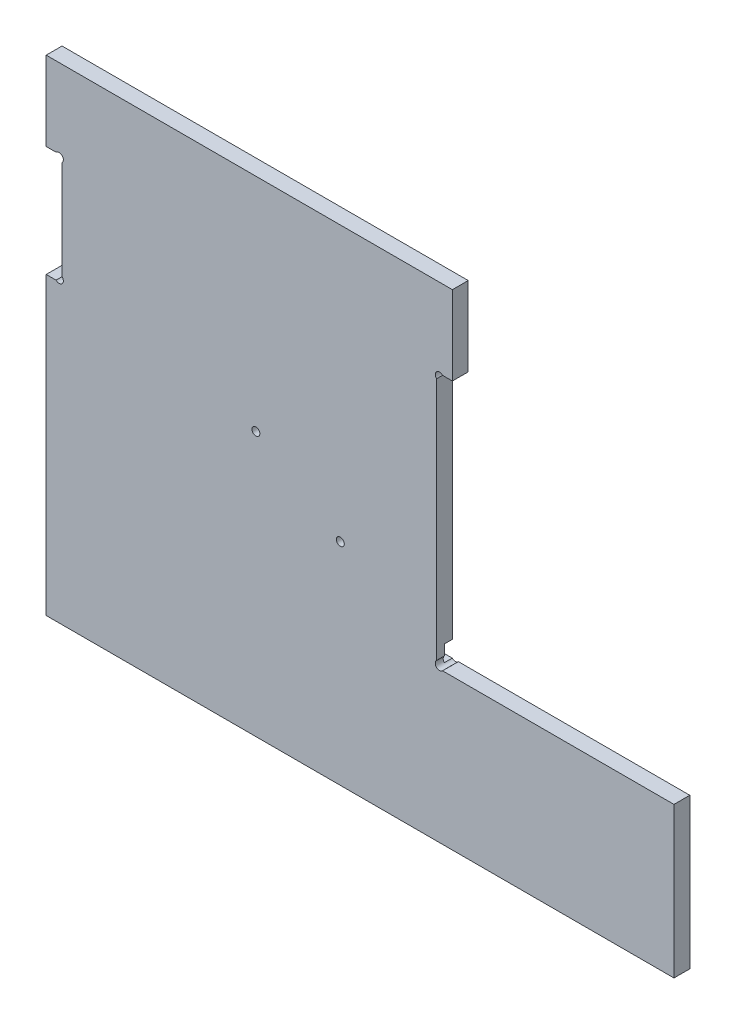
ISO-10303-21;
HEADER;
FILE_DESCRIPTION(('STEP AP214'),'2;1');
FILE_NAME('part.step','',(''),(''),'','','');
FILE_SCHEMA(('AUTOMOTIVE_DESIGN { 1 0 10303 214 1 1 1 1 }'));
ENDSEC;
DATA;
#1=APPLICATION_CONTEXT('core data for automotive mechanical design processes');
#2=APPLICATION_PROTOCOL_DEFINITION('international standard','automotive_design',2000,#1);
#3=PRODUCT_CONTEXT('',#1,'mechanical');
#4=PRODUCT('Part','Part','',(#3));
#5=PRODUCT_RELATED_PRODUCT_CATEGORY('part','',(#4));
#6=PRODUCT_DEFINITION_FORMATION('','',#4);
#7=PRODUCT_DEFINITION_CONTEXT('part definition',#1,'design');
#8=PRODUCT_DEFINITION('design','',#6,#7);
#9=PRODUCT_DEFINITION_SHAPE('','',#8);
#10=(LENGTH_UNIT() NAMED_UNIT(*) SI_UNIT(.MILLI.,.METRE.));
#11=(NAMED_UNIT(*) PLANE_ANGLE_UNIT() SI_UNIT($,.RADIAN.));
#12=(NAMED_UNIT(*) SI_UNIT($,.STERADIAN.) SOLID_ANGLE_UNIT());
#13=UNCERTAINTY_MEASURE_WITH_UNIT(LENGTH_MEASURE(1.E-05),#10,'distance_accuracy_value','');
#14=(GEOMETRIC_REPRESENTATION_CONTEXT(3) GLOBAL_UNCERTAINTY_ASSIGNED_CONTEXT((#13)) GLOBAL_UNIT_ASSIGNED_CONTEXT((#10,
#11,#12)) REPRESENTATION_CONTEXT('',''));
#15=CARTESIAN_POINT('',(0.,0.,0.));
#16=DIRECTION('',(0.,0.,1.));
#17=DIRECTION('',(1.,0.,0.));
#18=AXIS2_PLACEMENT_3D('',#15,#16,#17);
#19=CARTESIAN_POINT('',(132.817421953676,-51.030312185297,6.));
#20=DIRECTION('',(0.,-1.,0.));
#21=DIRECTION('',(1.,0.,0.));
#22=AXIS2_PLACEMENT_3D('',#19,#20,#21);
#23=PLANE('',#22);
#24=DIRECTION('',(-1.,0.,0.));
#25=VECTOR('',#24,1.);
#26=CARTESIAN_POINT('',(132.817421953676,-51.030312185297,3.));
#27=LINE('',#26,#25);
#28=CARTESIAN_POINT('',(132.755526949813,-51.030312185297,3.));
#29=VERTEX_POINT('',#28);
#30=CARTESIAN_POINT('',(113.079316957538,-51.030312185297,3.));
#31=VERTEX_POINT('',#30);
#32=EDGE_CURVE('E391',#29,#31,#27,.T.);
#33=ORIENTED_EDGE('',*,*,#32,.F.);
#34=DIRECTION('',(0.,0.,-1.));
#35=VECTOR('',#34,1.);
#36=CARTESIAN_POINT('',(132.755526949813,-51.030312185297,6.));
#37=LINE('',#36,#35);
#38=CARTESIAN_POINT('',(132.755526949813,-51.030312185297,0.));
#39=VERTEX_POINT('',#38);
#40=EDGE_CURVE('E549',#29,#39,#37,.T.);
#41=ORIENTED_EDGE('',*,*,#40,.T.);
#42=DIRECTION('',(-1.,0.,0.));
#43=VECTOR('',#42,1.);
#44=CARTESIAN_POINT('',(132.817421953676,-51.030312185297,0.));
#45=LINE('',#44,#43);
#46=CARTESIAN_POINT('',(113.079316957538,-51.030312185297,0.));
#47=VERTEX_POINT('',#46);
#48=EDGE_CURVE('E458',#39,#47,#45,.T.);
#49=ORIENTED_EDGE('',*,*,#48,.T.);
#50=DIRECTION('',(0.,0.,-1.));
#51=VECTOR('',#50,1.);
#52=CARTESIAN_POINT('',(113.079316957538,-51.030312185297,3.));
#53=LINE('',#52,#51);
#54=EDGE_CURVE('E575',#47,#31,#53,.F.);
#55=ORIENTED_EDGE('',*,*,#54,.T.);
#56=EDGE_LOOP('',(#33,#41,#49,#55));
#57=FACE_BOUND('',#56,.T.);
#58=ADVANCED_FACE('F32',(#57),#23,.F.);
#59=CARTESIAN_POINT('',(-15.1825780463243,75.9696878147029,6.));
#60=DIRECTION('',(1.,0.,0.));
#61=DIRECTION('',(0.,1.,0.));
#62=AXIS2_PLACEMENT_3D('',#59,#60,#61);
#63=PLANE('',#62);
#64=DIRECTION('',(0.,-1.,0.));
#65=VECTOR('',#64,1.);
#66=CARTESIAN_POINT('',(-15.1825780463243,75.9696878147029,6.));
#67=LINE('',#66,#65);
#68=CARTESIAN_POINT('',(-15.1825780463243,3.96968781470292,6.));
#69=VERTEX_POINT('',#68);
#70=CARTESIAN_POINT('',(-15.1825780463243,-108.030312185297,6.));
#71=VERTEX_POINT('',#70);
#72=EDGE_CURVE('E486',#69,#71,#67,.T.);
#73=ORIENTED_EDGE('',*,*,#72,.F.);
#74=DIRECTION('',(0.,0.,-1.));
#75=VECTOR('',#74,1.);
#76=CARTESIAN_POINT('',(-15.1825780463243,3.96968781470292,6.));
#77=LINE('',#76,#75);
#78=CARTESIAN_POINT('',(-15.1825780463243,3.96968781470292,0.));
#79=VERTEX_POINT('',#78);
#80=EDGE_CURVE('E351',#69,#79,#77,.T.);
#81=ORIENTED_EDGE('',*,*,#80,.T.);
#82=DIRECTION('',(0.,-1.,0.));
#83=VECTOR('',#82,1.);
#84=CARTESIAN_POINT('',(-15.1825780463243,75.9696878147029,0.));
#85=LINE('',#84,#83);
#86=CARTESIAN_POINT('',(-15.1825780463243,-108.030312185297,0.));
#87=VERTEX_POINT('',#86);
#88=EDGE_CURVE('E467',#79,#87,#85,.T.);
#89=ORIENTED_EDGE('',*,*,#88,.T.);
#90=DIRECTION('',(0.,0.,-1.));
#91=VECTOR('',#90,1.);
#92=CARTESIAN_POINT('',(-15.1825780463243,-108.030312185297,6.));
#93=LINE('',#92,#91);
#94=EDGE_CURVE('E490',#71,#87,#93,.T.);
#95=ORIENTED_EDGE('',*,*,#94,.F.);
#96=EDGE_LOOP('',(#73,#81,#89,#95));
#97=FACE_BOUND('',#96,.T.);
#98=ADVANCED_FACE('F732',(#97),#63,.F.);
#99=CARTESIAN_POINT('',(132.817421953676,75.9696878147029,6.));
#100=DIRECTION('',(-1.,0.,0.));
#101=DIRECTION('',(0.,-1.,0.));
#102=AXIS2_PLACEMENT_3D('',#99,#100,#101);
#103=PLANE('',#102);
#104=DIRECTION('',(0.,1.,0.));
#105=VECTOR('',#104,1.);
#106=CARTESIAN_POINT('',(132.817421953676,75.9696878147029,0.));
#107=LINE('',#106,#105);
#108=CARTESIAN_POINT('',(132.817421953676,-44.830312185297,0.));
#109=VERTEX_POINT('',#108);
#110=CARTESIAN_POINT('',(132.817421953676,43.7077928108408,0.));
#111=VERTEX_POINT('',#110);
#112=EDGE_CURVE('E462',#109,#111,#107,.T.);
#113=ORIENTED_EDGE('',*,*,#112,.T.);
#114=DIRECTION('',(0.,0.,-1.));
#115=VECTOR('',#114,1.);
#116=CARTESIAN_POINT('',(132.817421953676,43.7077928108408,6.));
#117=LINE('',#116,#115);
#118=CARTESIAN_POINT('',(132.817421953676,43.7077928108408,6.));
#119=VERTEX_POINT('',#118);
#120=EDGE_CURVE('E541',#111,#119,#117,.F.);
#121=ORIENTED_EDGE('',*,*,#120,.T.);
#122=DIRECTION('',(0.,1.,0.));
#123=VECTOR('',#122,1.);
#124=CARTESIAN_POINT('',(132.817421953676,75.9696878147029,6.));
#125=LINE('',#124,#123);
#126=CARTESIAN_POINT('',(132.817421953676,-48.7684171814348,6.));
#127=VERTEX_POINT('',#126);
#128=EDGE_CURVE('E481',#127,#119,#125,.T.);
#129=ORIENTED_EDGE('',*,*,#128,.F.);
#130=DIRECTION('',(0.,0.,-1.));
#131=VECTOR('',#130,1.);
#132=CARTESIAN_POINT('',(132.817421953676,-48.7684171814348,6.));
#133=LINE('',#132,#131);
#134=CARTESIAN_POINT('',(132.817421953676,-48.7684171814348,3.));
#135=VERTEX_POINT('',#134);
#136=EDGE_CURVE('E552',#127,#135,#133,.T.);
#137=ORIENTED_EDGE('',*,*,#136,.T.);
#138=DIRECTION('',(0.,-1.,0.));
#139=VECTOR('',#138,1.);
#140=CARTESIAN_POINT('',(132.817421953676,-51.030312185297,3.));
#141=LINE('',#140,#139);
#142=CARTESIAN_POINT('',(132.817421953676,-44.830312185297,3.));
#143=VERTEX_POINT('',#142);
#144=EDGE_CURVE('E388',#143,#135,#141,.T.);
#145=ORIENTED_EDGE('',*,*,#144,.F.);
#146=DIRECTION('',(0.,0.,-1.));
#147=VECTOR('',#146,1.);
#148=CARTESIAN_POINT('',(132.817421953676,-44.830312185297,3.));
#149=LINE('',#148,#147);
#150=EDGE_CURVE('E397',#143,#109,#149,.T.);
#151=ORIENTED_EDGE('',*,*,#150,.T.);
#152=EDGE_LOOP('',(#113,#121,#129,#137,#145,#151));
#153=FACE_BOUND('',#152,.T.);
#154=ADVANCED_FACE('F738',(#153),#103,.F.);
#155=CARTESIAN_POINT('',(222.817421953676,-51.030312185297,6.));
#156=DIRECTION('',(-1.,0.,0.));
#157=DIRECTION('',(0.,0.,1.));
#158=AXIS2_PLACEMENT_3D('',#155,#156,#157);
#159=PLANE('',#158);
#160=DIRECTION('',(0.,1.,0.));
#161=VECTOR('',#160,1.);
#162=CARTESIAN_POINT('',(222.817421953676,-51.030312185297,0.));
#163=LINE('',#162,#161);
#164=CARTESIAN_POINT('',(222.817421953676,-108.030312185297,0.));
#165=VERTEX_POINT('',#164);
#166=CARTESIAN_POINT('',(222.817421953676,-51.030312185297,0.));
#167=VERTEX_POINT('',#166);
#168=EDGE_CURVE('E456',#165,#167,#163,.T.);
#169=ORIENTED_EDGE('',*,*,#168,.T.);
#170=DIRECTION('',(0.,0.,-1.));
#171=VECTOR('',#170,1.);
#172=CARTESIAN_POINT('',(222.817421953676,-51.030312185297,6.));
#173=LINE('',#172,#171);
#174=CARTESIAN_POINT('',(222.817421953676,-51.030312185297,6.));
#175=VERTEX_POINT('',#174);
#176=EDGE_CURVE('E496',#175,#167,#173,.T.);
#177=ORIENTED_EDGE('',*,*,#176,.F.);
#178=DIRECTION('',(0.,1.,0.));
#179=VECTOR('',#178,1.);
#180=CARTESIAN_POINT('',(222.817421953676,-51.030312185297,6.));
#181=LINE('',#180,#179);
#182=CARTESIAN_POINT('',(222.817421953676,-108.030312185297,6.));
#183=VERTEX_POINT('',#182);
#184=EDGE_CURVE('E476',#183,#175,#181,.T.);
#185=ORIENTED_EDGE('',*,*,#184,.F.);
#186=DIRECTION('',(0.,0.,-1.));
#187=VECTOR('',#186,1.);
#188=CARTESIAN_POINT('',(222.817421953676,-108.030312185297,6.));
#189=LINE('',#188,#187);
#190=EDGE_CURVE('E499',#183,#165,#189,.T.);
#191=ORIENTED_EDGE('',*,*,#190,.T.);
#192=EDGE_LOOP('',(#169,#177,#185,#191));
#193=FACE_BOUND('',#192,.T.);
#194=ADVANCED_FACE('F34',(#193),#159,.F.);
#195=CARTESIAN_POINT('',(135.079316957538,-51.030312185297,0.));
#196=VERTEX_POINT('',#195);
#197=EDGE_CURVE('E459',#167,#196,#45,.T.);
#198=ORIENTED_EDGE('',*,*,#197,.T.);
#199=DIRECTION('',(0.,0.,-1.));
#200=VECTOR('',#199,1.);
#201=CARTESIAN_POINT('',(135.079316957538,-51.030312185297,6.));
#202=LINE('',#201,#200);
#203=CARTESIAN_POINT('',(135.079316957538,-51.030312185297,6.));
#204=VERTEX_POINT('',#203);
#205=EDGE_CURVE('E555',#196,#204,#202,.F.);
#206=ORIENTED_EDGE('',*,*,#205,.T.);
#207=DIRECTION('',(-1.,0.,0.));
#208=VECTOR('',#207,1.);
#209=CARTESIAN_POINT('',(132.817421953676,-51.030312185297,6.));
#210=LINE('',#209,#208);
#211=EDGE_CURVE('E478',#175,#204,#210,.T.);
#212=ORIENTED_EDGE('',*,*,#211,.F.);
#213=ORIENTED_EDGE('',*,*,#176,.T.);
#214=EDGE_LOOP('',(#198,#206,#212,#213));
#215=FACE_BOUND('',#214,.T.);
#216=ADVANCED_FACE('F734',(#215),#23,.F.);
#217=CARTESIAN_POINT('',(-15.1825780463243,75.9696878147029,6.));
#218=DIRECTION('',(0.,-1.,0.));
#219=DIRECTION('',(0.,0.,-1.));
#220=AXIS2_PLACEMENT_3D('',#217,#218,#219);
#221=PLANE('',#220);
#222=DIRECTION('',(-1.,0.,0.));
#223=VECTOR('',#222,1.);
#224=CARTESIAN_POINT('',(-15.1825780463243,75.9696878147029,0.));
#225=LINE('',#224,#223);
#226=CARTESIAN_POINT('',(138.817421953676,75.9696878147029,0.));
#227=VERTEX_POINT('',#226);
#228=CARTESIAN_POINT('',(-15.1825780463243,75.9696878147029,0.));
#229=VERTEX_POINT('',#228);
#230=EDGE_CURVE('E465',#227,#229,#225,.T.);
#231=ORIENTED_EDGE('',*,*,#230,.T.);
#232=DIRECTION('',(0.,0.,-1.));
#233=VECTOR('',#232,1.);
#234=CARTESIAN_POINT('',(-15.1825780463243,75.9696878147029,6.));
#235=LINE('',#234,#233);
#236=CARTESIAN_POINT('',(-15.1825780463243,75.9696878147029,6.));
#237=VERTEX_POINT('',#236);
#238=EDGE_CURVE('E493',#237,#229,#235,.T.);
#239=ORIENTED_EDGE('',*,*,#238,.F.);
#240=DIRECTION('',(-1.,0.,0.));
#241=VECTOR('',#240,1.);
#242=CARTESIAN_POINT('',(-15.1825780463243,75.9696878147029,6.));
#243=LINE('',#242,#241);
#244=CARTESIAN_POINT('',(138.817421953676,75.9696878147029,6.));
#245=VERTEX_POINT('',#244);
#246=EDGE_CURVE('E484',#245,#237,#243,.T.);
#247=ORIENTED_EDGE('',*,*,#246,.F.);
#248=DIRECTION('',(0.,0.,1.));
#249=VECTOR('',#248,1.);
#250=CARTESIAN_POINT('',(138.817421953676,75.9696878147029,6.));
#251=LINE('',#250,#249);
#252=EDGE_CURVE('E367',#227,#245,#251,.T.);
#253=ORIENTED_EDGE('',*,*,#252,.F.);
#254=EDGE_LOOP('',(#231,#239,#247,#253));
#255=FACE_BOUND('',#254,.T.);
#256=ADVANCED_FACE('F744',(#255),#221,.F.);
#257=CARTESIAN_POINT('',(-15.1825780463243,45.9696878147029,0.));
#258=VERTEX_POINT('',#257);
#259=EDGE_CURVE('E468',#229,#258,#85,.T.);
#260=ORIENTED_EDGE('',*,*,#259,.T.);
#261=DIRECTION('',(0.,0.,-1.));
#262=VECTOR('',#261,1.);
#263=CARTESIAN_POINT('',(-15.1825780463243,45.9696878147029,6.));
#264=LINE('',#263,#262);
#265=CARTESIAN_POINT('',(-15.1825780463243,45.9696878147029,6.));
#266=VERTEX_POINT('',#265);
#267=EDGE_CURVE('E350',#266,#258,#264,.T.);
#268=ORIENTED_EDGE('',*,*,#267,.F.);
#269=EDGE_CURVE('E487',#237,#266,#67,.T.);
#270=ORIENTED_EDGE('',*,*,#269,.F.);
#271=ORIENTED_EDGE('',*,*,#238,.T.);
#272=EDGE_LOOP('',(#260,#268,#270,#271));
#273=FACE_BOUND('',#272,.T.);
#274=ADVANCED_FACE('F525',(#273),#63,.F.);
#275=CARTESIAN_POINT('',(118.817421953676,-108.030312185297,6.));
#276=DIRECTION('',(0.,1.,0.));
#277=DIRECTION('',(-1.,0.,0.));
#278=AXIS2_PLACEMENT_3D('',#275,#276,#277);
#279=PLANE('',#278);
#280=DIRECTION('',(1.,0.,0.));
#281=VECTOR('',#280,1.);
#282=CARTESIAN_POINT('',(118.817421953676,-108.030312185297,0.));
#283=LINE('',#282,#281);
#284=EDGE_CURVE('E471',#87,#165,#283,.T.);
#285=ORIENTED_EDGE('',*,*,#284,.T.);
#286=ORIENTED_EDGE('',*,*,#190,.F.);
#287=DIRECTION('',(1.,0.,0.));
#288=VECTOR('',#287,1.);
#289=CARTESIAN_POINT('',(222.817421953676,-108.030312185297,6.));
#290=LINE('',#289,#288);
#291=EDGE_CURVE('E473',#71,#183,#290,.T.);
#292=ORIENTED_EDGE('',*,*,#291,.F.);
#293=ORIENTED_EDGE('',*,*,#94,.T.);
#294=EDGE_LOOP('',(#285,#286,#292,#293));
#295=FACE_BOUND('',#294,.T.);
#296=ADVANCED_FACE('F792',(#295),#279,.F.);
#297=CARTESIAN_POINT('',(132.817421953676,-108.030312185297,6.));
#298=DIRECTION('',(0.,0.,1.));
#299=DIRECTION('',(1.,0.,0.));
#300=AXIS2_PLACEMENT_3D('',#297,#298,#299);
#301=PLANE('',#300);
#302=CARTESIAN_POINT('',(-10.2825780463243,5.06968781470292,6.));
#303=DIRECTION('',(0.,0.,-1.));
#304=DIRECTION('',(-1.,0.,0.));
#305=AXIS2_PLACEMENT_3D('',#302,#303,#304);
#306=CIRCLE('',#305,1.6);
#307=CARTESIAN_POINT('',(-9.18257804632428,6.23158281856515,6.));
#308=VERTEX_POINT('',#307);
#309=CARTESIAN_POINT('',(-11.4444730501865,3.96968781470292,6.));
#310=VERTEX_POINT('',#309);
#311=EDGE_CURVE('E313',#308,#310,#306,.T.);
#312=ORIENTED_EDGE('',*,*,#311,.T.);
#313=DIRECTION('',(-1.,0.,0.));
#314=VECTOR('',#313,1.);
#315=CARTESIAN_POINT('',(-15.1825780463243,3.96968781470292,6.));
#316=LINE('',#315,#314);
#317=EDGE_CURVE('E348',#310,#69,#316,.T.);
#318=ORIENTED_EDGE('',*,*,#317,.T.);
#319=ORIENTED_EDGE('',*,*,#72,.T.);
#320=ORIENTED_EDGE('',*,*,#291,.T.);
#321=ORIENTED_EDGE('',*,*,#184,.T.);
#322=ORIENTED_EDGE('',*,*,#211,.T.);
#323=CARTESIAN_POINT('',(133.917421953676,-49.930312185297,6.));
#324=DIRECTION('',(0.,0.,-1.));
#325=DIRECTION('',(-1.,0.,0.));
#326=AXIS2_PLACEMENT_3D('',#323,#324,#325);
#327=CIRCLE('',#326,1.60000000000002);
#328=EDGE_CURVE('E546',#204,#127,#327,.T.);
#329=ORIENTED_EDGE('',*,*,#328,.T.);
#330=ORIENTED_EDGE('',*,*,#128,.T.);
#331=CARTESIAN_POINT('',(133.917421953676,44.8696878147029,6.));
#332=DIRECTION('',(0.,0.,-1.));
#333=DIRECTION('',(-1.,0.,0.));
#334=AXIS2_PLACEMENT_3D('',#331,#332,#333);
#335=CIRCLE('',#334,1.59999999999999);
#336=CARTESIAN_POINT('',(135.079316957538,45.9696878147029,6.));
#337=VERTEX_POINT('',#336);
#338=EDGE_CURVE('E538',#119,#337,#335,.T.);
#339=ORIENTED_EDGE('',*,*,#338,.T.);
#340=DIRECTION('',(-1.,0.,0.));
#341=VECTOR('',#340,1.);
#342=CARTESIAN_POINT('',(138.817421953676,45.9696878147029,6.));
#343=LINE('',#342,#341);
#344=CARTESIAN_POINT('',(138.817421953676,45.9696878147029,6.));
#345=VERTEX_POINT('',#344);
#346=EDGE_CURVE('E373',#345,#337,#343,.T.);
#347=ORIENTED_EDGE('',*,*,#346,.F.);
#348=DIRECTION('',(0.,-1.,0.));
#349=VECTOR('',#348,1.);
#350=CARTESIAN_POINT('',(138.817421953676,75.9696878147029,6.));
#351=LINE('',#350,#349);
#352=EDGE_CURVE('E359',#245,#345,#351,.T.);
#353=ORIENTED_EDGE('',*,*,#352,.F.);
#354=ORIENTED_EDGE('',*,*,#246,.T.);
#355=ORIENTED_EDGE('',*,*,#269,.T.);
#356=DIRECTION('',(1.,0.,0.));
#357=VECTOR('',#356,1.);
#358=CARTESIAN_POINT('',(-15.1825780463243,45.9696878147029,6.));
#359=LINE('',#358,#357);
#360=CARTESIAN_POINT('',(-11.4444730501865,45.9696878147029,6.));
#361=VERTEX_POINT('',#360);
#362=EDGE_CURVE('E343',#266,#361,#359,.T.);
#363=ORIENTED_EDGE('',*,*,#362,.T.);
#364=CARTESIAN_POINT('',(-10.2825780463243,44.8696878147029,6.));
#365=DIRECTION('',(0.,0.,-1.));
#366=DIRECTION('',(-1.,0.,0.));
#367=AXIS2_PLACEMENT_3D('',#364,#365,#366);
#368=CIRCLE('',#367,1.6);
#369=CARTESIAN_POINT('',(-9.18257804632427,43.7077928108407,6.));
#370=VERTEX_POINT('',#369);
#371=EDGE_CURVE('E54',#361,#370,#368,.T.);
#372=ORIENTED_EDGE('',*,*,#371,.T.);
#373=DIRECTION('',(0.,-1.,0.));
#374=VECTOR('',#373,1.);
#375=CARTESIAN_POINT('',(-9.18257804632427,45.9696878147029,6.));
#376=LINE('',#375,#374);
#377=EDGE_CURVE('E346',#370,#308,#376,.T.);
#378=ORIENTED_EDGE('',*,*,#377,.T.);
#379=EDGE_LOOP('',(#312,#318,#319,#320,#321,#322,#329,#330,#339,#347,#353,#354,#355,#363,#372,#378));
#380=FACE_BOUND('',#379,.T.);
#381=CARTESIAN_POINT('',(64.3174219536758,-7.83031218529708,6.));
#382=DIRECTION('',(0.,0.,-1.));
#383=DIRECTION('',(-1.,0.,0.));
#384=AXIS2_PLACEMENT_3D('',#381,#382,#383);
#385=CIRCLE('',#384,1.5);
#386=CARTESIAN_POINT('',(62.8174219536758,-7.83031218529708,6.));
#387=VERTEX_POINT('',#386);
#388=EDGE_CURVE('E376',#387,#387,#385,.T.);
#389=ORIENTED_EDGE('',*,*,#388,.T.);
#390=EDGE_LOOP('',(#389));
#391=FACE_BOUND('',#390,.T.);
#392=CARTESIAN_POINT('',(96.3174219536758,-28.0303121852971,6.));
#393=DIRECTION('',(0.,0.,-1.));
#394=DIRECTION('',(-1.,0.,0.));
#395=AXIS2_PLACEMENT_3D('',#392,#393,#394);
#396=CIRCLE('',#395,1.5);
#397=CARTESIAN_POINT('',(94.8174219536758,-28.0303121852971,6.));
#398=VERTEX_POINT('',#397);
#399=EDGE_CURVE('E380',#398,#398,#396,.T.);
#400=ORIENTED_EDGE('',*,*,#399,.T.);
#401=EDGE_LOOP('',(#400));
#402=FACE_BOUND('',#401,.T.);
#403=ADVANCED_FACE('F519',(#380,#391,#402),#301,.T.);
#404=CARTESIAN_POINT('',(132.817421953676,-108.030312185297,0.));
#405=DIRECTION('',(0.,0.,1.));
#406=DIRECTION('',(1.,0.,0.));
#407=AXIS2_PLACEMENT_3D('',#404,#405,#406);
#408=PLANE('',#407);
#409=DIRECTION('',(-1.,0.,0.));
#410=VECTOR('',#409,1.);
#411=CARTESIAN_POINT('',(81.8174219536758,-11.0303121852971,0.));
#412=LINE('',#411,#410);
#413=CARTESIAN_POINT('',(79.5555269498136,-11.0303121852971,0.));
#414=VERTEX_POINT('',#413);
#415=CARTESIAN_POINT('',(49.079316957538,-11.0303121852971,0.));
#416=VERTEX_POINT('',#415);
#417=EDGE_CURVE('E419',#414,#416,#412,.T.);
#418=ORIENTED_EDGE('',*,*,#417,.F.);
#419=CARTESIAN_POINT('',(80.7174219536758,-9.93031218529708,0.));
#420=DIRECTION('',(0.,0.,-1.));
#421=DIRECTION('',(-1.,0.,0.));
#422=AXIS2_PLACEMENT_3D('',#419,#420,#421);
#423=CIRCLE('',#422,1.6);
#424=CARTESIAN_POINT('',(81.8174219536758,-8.76841718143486,0.));
#425=VERTEX_POINT('',#424);
#426=EDGE_CURVE('E600',#425,#414,#423,.T.);
#427=ORIENTED_EDGE('',*,*,#426,.F.);
#428=DIRECTION('',(0.,-1.,0.));
#429=VECTOR('',#428,1.);
#430=CARTESIAN_POINT('',(81.8174219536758,-4.83031218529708,0.));
#431=LINE('',#430,#429);
#432=CARTESIAN_POINT('',(81.8174219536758,-7.09220718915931,0.));
#433=VERTEX_POINT('',#432);
#434=EDGE_CURVE('E416',#433,#425,#431,.T.);
#435=ORIENTED_EDGE('',*,*,#434,.F.);
#436=CARTESIAN_POINT('',(80.7174219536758,-5.93031218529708,0.));
#437=DIRECTION('',(0.,0.,-1.));
#438=DIRECTION('',(-1.,0.,0.));
#439=AXIS2_PLACEMENT_3D('',#436,#437,#438);
#440=CIRCLE('',#439,1.60000000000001);
#441=CARTESIAN_POINT('',(79.5555269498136,-4.83031218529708,0.));
#442=VERTEX_POINT('',#441);
#443=EDGE_CURVE('E621',#442,#433,#440,.T.);
#444=ORIENTED_EDGE('',*,*,#443,.F.);
#445=DIRECTION('',(1.,0.,0.));
#446=VECTOR('',#445,1.);
#447=CARTESIAN_POINT('',(81.8174219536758,-4.83031218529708,0.));
#448=LINE('',#447,#446);
#449=CARTESIAN_POINT('',(49.079316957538,-4.83031218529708,0.));
#450=VERTEX_POINT('',#449);
#451=EDGE_CURVE('E423',#450,#442,#448,.T.);
#452=ORIENTED_EDGE('',*,*,#451,.F.);
#453=CARTESIAN_POINT('',(47.9174219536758,-5.93031218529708,0.));
#454=DIRECTION('',(0.,0.,-1.));
#455=DIRECTION('',(-1.,0.,0.));
#456=AXIS2_PLACEMENT_3D('',#453,#454,#455);
#457=CIRCLE('',#456,1.60000000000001);
#458=CARTESIAN_POINT('',(46.8174219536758,-7.09220718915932,0.));
#459=VERTEX_POINT('',#458);
#460=EDGE_CURVE('E632',#459,#450,#457,.T.);
#461=ORIENTED_EDGE('',*,*,#460,.F.);
#462=DIRECTION('',(0.,1.,0.));
#463=VECTOR('',#462,1.);
#464=CARTESIAN_POINT('',(46.8174219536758,-4.83031218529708,0.));
#465=LINE('',#464,#463);
#466=CARTESIAN_POINT('',(46.8174219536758,-8.76841718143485,0.));
#467=VERTEX_POINT('',#466);
#468=EDGE_CURVE('E421',#467,#459,#465,.T.);
#469=ORIENTED_EDGE('',*,*,#468,.F.);
#470=CARTESIAN_POINT('',(47.9174219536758,-9.93031218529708,0.));
#471=DIRECTION('',(0.,0.,-1.));
#472=DIRECTION('',(-1.,0.,0.));
#473=AXIS2_PLACEMENT_3D('',#470,#471,#472);
#474=CIRCLE('',#473,1.6);
#475=EDGE_CURVE('E610',#416,#467,#474,.T.);
#476=ORIENTED_EDGE('',*,*,#475,.F.);
#477=EDGE_LOOP('',(#418,#427,#435,#444,#452,#461,#469,#476));
#478=FACE_BOUND('',#477,.T.);
#479=DIRECTION('',(0.,1.,0.));
#480=VECTOR('',#479,1.);
#481=CARTESIAN_POINT('',(78.8174219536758,-24.8303121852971,0.));
#482=LINE('',#481,#480);
#483=CARTESIAN_POINT('',(78.8174219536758,-28.7684171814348,0.));
#484=VERTEX_POINT('',#483);
#485=CARTESIAN_POINT('',(78.8174219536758,-27.0922071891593,0.));
#486=VERTEX_POINT('',#485);
#487=EDGE_CURVE('E442',#484,#486,#482,.T.);
#488=ORIENTED_EDGE('',*,*,#487,.F.);
#489=CARTESIAN_POINT('',(79.9174219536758,-29.9303121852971,0.));
#490=DIRECTION('',(0.,0.,-1.));
#491=DIRECTION('',(-1.,0.,0.));
#492=AXIS2_PLACEMENT_3D('',#489,#490,#491);
#493=CIRCLE('',#492,1.6);
#494=CARTESIAN_POINT('',(81.079316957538,-31.0303121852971,0.));
#495=VERTEX_POINT('',#494);
#496=EDGE_CURVE('E643',#495,#484,#493,.T.);
#497=ORIENTED_EDGE('',*,*,#496,.F.);
#498=DIRECTION('',(-1.,0.,0.));
#499=VECTOR('',#498,1.);
#500=CARTESIAN_POINT('',(113.817421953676,-31.0303121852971,0.));
#501=LINE('',#500,#499);
#502=CARTESIAN_POINT('',(111.555526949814,-31.0303121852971,0.));
#503=VERTEX_POINT('',#502);
#504=EDGE_CURVE('E439',#503,#495,#501,.T.);
#505=ORIENTED_EDGE('',*,*,#504,.F.);
#506=CARTESIAN_POINT('',(112.717421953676,-29.9303121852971,0.));
#507=DIRECTION('',(0.,0.,-1.));
#508=DIRECTION('',(-1.,0.,0.));
#509=AXIS2_PLACEMENT_3D('',#506,#507,#508);
#510=CIRCLE('',#509,1.6);
#511=CARTESIAN_POINT('',(113.817421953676,-28.7684171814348,0.));
#512=VERTEX_POINT('',#511);
#513=EDGE_CURVE('E665',#512,#503,#510,.T.);
#514=ORIENTED_EDGE('',*,*,#513,.F.);
#515=DIRECTION('',(0.,-1.,0.));
#516=VECTOR('',#515,1.);
#517=CARTESIAN_POINT('',(113.817421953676,-24.8303121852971,0.));
#518=LINE('',#517,#516);
#519=CARTESIAN_POINT('',(113.817421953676,-27.0922071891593,0.));
#520=VERTEX_POINT('',#519);
#521=EDGE_CURVE('E436',#520,#512,#518,.T.);
#522=ORIENTED_EDGE('',*,*,#521,.F.);
#523=CARTESIAN_POINT('',(112.717421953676,-25.9303121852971,0.));
#524=DIRECTION('',(0.,0.,-1.));
#525=DIRECTION('',(-1.,0.,0.));
#526=AXIS2_PLACEMENT_3D('',#523,#524,#525);
#527=CIRCLE('',#526,1.6);
#528=CARTESIAN_POINT('',(111.555526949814,-24.8303121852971,0.));
#529=VERTEX_POINT('',#528);
#530=EDGE_CURVE('E675',#529,#520,#527,.T.);
#531=ORIENTED_EDGE('',*,*,#530,.F.);
#532=DIRECTION('',(1.,0.,0.));
#533=VECTOR('',#532,1.);
#534=CARTESIAN_POINT('',(113.817421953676,-24.8303121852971,0.));
#535=LINE('',#534,#533);
#536=CARTESIAN_POINT('',(81.079316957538,-24.8303121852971,0.));
#537=VERTEX_POINT('',#536);
#538=EDGE_CURVE('E444',#537,#529,#535,.T.);
#539=ORIENTED_EDGE('',*,*,#538,.F.);
#540=CARTESIAN_POINT('',(79.9174219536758,-25.9303121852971,0.));
#541=DIRECTION('',(0.,0.,-1.));
#542=DIRECTION('',(-1.,0.,0.));
#543=AXIS2_PLACEMENT_3D('',#540,#541,#542);
#544=CIRCLE('',#543,1.6);
#545=EDGE_CURVE('E654',#486,#537,#544,.T.);
#546=ORIENTED_EDGE('',*,*,#545,.F.);
#547=EDGE_LOOP('',(#488,#497,#505,#514,#522,#531,#539,#546));
#548=FACE_BOUND('',#547,.T.);
#549=DIRECTION('',(-1.,0.,0.));
#550=VECTOR('',#549,1.);
#551=CARTESIAN_POINT('',(-15.1825780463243,3.96968781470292,0.));
#552=LINE('',#551,#550);
#553=CARTESIAN_POINT('',(-11.4444730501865,3.96968781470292,0.));
#554=VERTEX_POINT('',#553);
#555=EDGE_CURVE('E327',#554,#79,#552,.T.);
#556=ORIENTED_EDGE('',*,*,#555,.F.);
#557=CARTESIAN_POINT('',(-10.2825780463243,5.06968781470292,0.));
#558=DIRECTION('',(0.,0.,-1.));
#559=DIRECTION('',(-1.,0.,0.));
#560=AXIS2_PLACEMENT_3D('',#557,#558,#559);
#561=CIRCLE('',#560,1.6);
#562=CARTESIAN_POINT('',(-9.18257804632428,6.23158281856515,0.));
#563=VERTEX_POINT('',#562);
#564=EDGE_CURVE('E47',#563,#554,#561,.T.);
#565=ORIENTED_EDGE('',*,*,#564,.F.);
#566=DIRECTION('',(0.,-1.,0.));
#567=VECTOR('',#566,1.);
#568=CARTESIAN_POINT('',(-9.18257804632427,45.9696878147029,0.));
#569=LINE('',#568,#567);
#570=CARTESIAN_POINT('',(-9.18257804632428,8.96968781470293,0.));
#571=VERTEX_POINT('',#570);
#572=EDGE_CURVE('E325',#571,#563,#569,.T.);
#573=ORIENTED_EDGE('',*,*,#572,.F.);
#574=DIRECTION('',(-1.,0.,0.));
#575=VECTOR('',#574,1.);
#576=CARTESIAN_POINT('',(49.8174219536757,8.96968781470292,0.));
#577=LINE('',#576,#575);
#578=CARTESIAN_POINT('',(47.5555269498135,8.96968781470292,0.));
#579=VERTEX_POINT('',#578);
#580=EDGE_CURVE('E403',#579,#571,#577,.T.);
#581=ORIENTED_EDGE('',*,*,#580,.F.);
#582=CARTESIAN_POINT('',(48.7174219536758,10.0696878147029,0.));
#583=DIRECTION('',(0.,0.,-1.));
#584=DIRECTION('',(-1.,0.,0.));
#585=AXIS2_PLACEMENT_3D('',#582,#583,#584);
#586=CIRCLE('',#585,1.6);
#587=CARTESIAN_POINT('',(49.8174219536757,11.2315828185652,0.));
#588=VERTEX_POINT('',#587);
#589=EDGE_CURVE('E558',#588,#579,#586,.T.);
#590=ORIENTED_EDGE('',*,*,#589,.F.);
#591=DIRECTION('',(0.,-1.,0.));
#592=VECTOR('',#591,1.);
#593=CARTESIAN_POINT('',(49.8174219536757,15.3696878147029,0.));
#594=LINE('',#593,#592);
#595=CARTESIAN_POINT('',(49.8174219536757,13.1077928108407,0.));
#596=VERTEX_POINT('',#595);
#597=EDGE_CURVE('E400',#596,#588,#594,.T.);
#598=ORIENTED_EDGE('',*,*,#597,.F.);
#599=CARTESIAN_POINT('',(48.7174219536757,14.2696878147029,0.));
#600=DIRECTION('',(0.,0.,-1.));
#601=DIRECTION('',(-1.,0.,0.));
#602=AXIS2_PLACEMENT_3D('',#599,#600,#601);
#603=CIRCLE('',#602,1.6);
#604=CARTESIAN_POINT('',(47.5555269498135,15.3696878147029,0.));
#605=VERTEX_POINT('',#604);
#606=EDGE_CURVE('E589',#605,#596,#603,.T.);
#607=ORIENTED_EDGE('',*,*,#606,.F.);
#608=DIRECTION('',(1.,0.,0.));
#609=VECTOR('',#608,1.);
#610=CARTESIAN_POINT('',(49.8174219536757,15.3696878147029,0.));
#611=LINE('',#610,#609);
#612=CARTESIAN_POINT('',(-9.18257804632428,15.3696878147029,0.));
#613=VERTEX_POINT('',#612);
#614=EDGE_CURVE('E405',#613,#605,#611,.T.);
#615=ORIENTED_EDGE('',*,*,#614,.F.);
#616=CARTESIAN_POINT('',(-9.18257804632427,43.7077928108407,0.));
#617=VERTEX_POINT('',#616);
#618=EDGE_CURVE('E334',#617,#613,#569,.T.);
#619=ORIENTED_EDGE('',*,*,#618,.F.);
#620=CARTESIAN_POINT('',(-10.2825780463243,44.8696878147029,0.));
#621=DIRECTION('',(0.,0.,-1.));
#622=DIRECTION('',(-1.,0.,0.));
#623=AXIS2_PLACEMENT_3D('',#620,#621,#622);
#624=CIRCLE('',#623,1.6);
#625=CARTESIAN_POINT('',(-11.4444730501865,45.9696878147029,0.));
#626=VERTEX_POINT('',#625);
#627=EDGE_CURVE('E318',#626,#617,#624,.T.);
#628=ORIENTED_EDGE('',*,*,#627,.F.);
#629=DIRECTION('',(1.,0.,0.));
#630=VECTOR('',#629,1.);
#631=CARTESIAN_POINT('',(-15.1825780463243,45.9696878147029,0.));
#632=LINE('',#631,#630);
#633=EDGE_CURVE('E335',#258,#626,#632,.T.);
#634=ORIENTED_EDGE('',*,*,#633,.F.);
#635=ORIENTED_EDGE('',*,*,#259,.F.);
#636=ORIENTED_EDGE('',*,*,#230,.F.);
#637=DIRECTION('',(0.,1.,0.));
#638=VECTOR('',#637,1.);
#639=CARTESIAN_POINT('',(138.817421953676,75.9696878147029,0.));
#640=LINE('',#639,#638);
#641=CARTESIAN_POINT('',(138.817421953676,45.9696878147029,0.));
#642=VERTEX_POINT('',#641);
#643=EDGE_CURVE('E364',#642,#227,#640,.T.);
#644=ORIENTED_EDGE('',*,*,#643,.F.);
#645=DIRECTION('',(-1.,0.,0.));
#646=VECTOR('',#645,1.);
#647=CARTESIAN_POINT('',(138.817421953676,45.9696878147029,0.));
#648=LINE('',#647,#646);
#649=CARTESIAN_POINT('',(135.079316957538,45.9696878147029,0.));
#650=VERTEX_POINT('',#649);
#651=EDGE_CURVE('E370',#642,#650,#648,.T.);
#652=ORIENTED_EDGE('',*,*,#651,.T.);
#653=CARTESIAN_POINT('',(133.917421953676,44.8696878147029,0.));
#654=DIRECTION('',(0.,0.,-1.));
#655=DIRECTION('',(-1.,0.,0.));
#656=AXIS2_PLACEMENT_3D('',#653,#654,#655);
#657=CIRCLE('',#656,1.59999999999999);
#658=EDGE_CURVE('E536',#111,#650,#657,.T.);
#659=ORIENTED_EDGE('',*,*,#658,.F.);
#660=ORIENTED_EDGE('',*,*,#112,.F.);
#661=DIRECTION('',(1.,0.,0.));
#662=VECTOR('',#661,1.);
#663=CARTESIAN_POINT('',(132.817421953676,-44.830312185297,0.));
#664=LINE('',#663,#662);
#665=CARTESIAN_POINT('',(113.079316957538,-44.830312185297,0.));
#666=VERTEX_POINT('',#665);
#667=EDGE_CURVE('E386',#666,#109,#664,.T.);
#668=ORIENTED_EDGE('',*,*,#667,.F.);
#669=CARTESIAN_POINT('',(111.917421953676,-45.930312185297,0.));
#670=DIRECTION('',(0.,0.,-1.));
#671=DIRECTION('',(-1.,0.,0.));
#672=AXIS2_PLACEMENT_3D('',#669,#670,#671);
#673=CIRCLE('',#672,1.60000000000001);
#674=CARTESIAN_POINT('',(110.817421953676,-47.0922071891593,0.));
#675=VERTEX_POINT('',#674);
#676=EDGE_CURVE('E578',#675,#666,#673,.T.);
#677=ORIENTED_EDGE('',*,*,#676,.F.);
#678=DIRECTION('',(0.,1.,0.));
#679=VECTOR('',#678,1.);
#680=CARTESIAN_POINT('',(110.817421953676,-51.030312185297,0.));
#681=LINE('',#680,#679);
#682=CARTESIAN_POINT('',(110.817421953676,-48.7684171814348,0.));
#683=VERTEX_POINT('',#682);
#684=EDGE_CURVE('E384',#683,#675,#681,.T.);
#685=ORIENTED_EDGE('',*,*,#684,.F.);
#686=CARTESIAN_POINT('',(111.917421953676,-49.930312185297,0.));
#687=DIRECTION('',(0.,0.,-1.));
#688=DIRECTION('',(-1.,0.,0.));
#689=AXIS2_PLACEMENT_3D('',#686,#687,#688);
#690=CIRCLE('',#689,1.60000000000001);
#691=EDGE_CURVE('E568',#47,#683,#690,.T.);
#692=ORIENTED_EDGE('',*,*,#691,.F.);
#693=ORIENTED_EDGE('',*,*,#48,.F.);
#694=CARTESIAN_POINT('',(133.917421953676,-49.930312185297,0.));
#695=DIRECTION('',(0.,0.,-1.));
#696=DIRECTION('',(-1.,0.,0.));
#697=AXIS2_PLACEMENT_3D('',#694,#695,#696);
#698=CIRCLE('',#697,1.60000000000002);
#699=EDGE_CURVE('E544',#196,#39,#698,.T.);
#700=ORIENTED_EDGE('',*,*,#699,.F.);
#701=ORIENTED_EDGE('',*,*,#197,.F.);
#702=ORIENTED_EDGE('',*,*,#168,.F.);
#703=ORIENTED_EDGE('',*,*,#284,.F.);
#704=ORIENTED_EDGE('',*,*,#88,.F.);
#705=EDGE_LOOP('',(#556,#565,#573,#581,#590,#598,#607,#615,#619,#628,#634,#635,#636,#644,#652,
#659,#660,#668,#677,#685,#692,#693,#700,#701,#702,#703,#704));
#706=FACE_BOUND('',#705,.T.);
#707=ADVANCED_FACE('F323',(#478,#548,#706),#408,.F.);
#708=CARTESIAN_POINT('',(113.817421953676,-24.8303121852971,3.));
#709=DIRECTION('',(1.,0.,0.));
#710=DIRECTION('',(0.,1.,0.));
#711=AXIS2_PLACEMENT_3D('',#708,#709,#710);
#712=PLANE('',#711);
#713=ORIENTED_EDGE('',*,*,#521,.T.);
#714=DIRECTION('',(0.,0.,-1.));
#715=VECTOR('',#714,1.);
#716=CARTESIAN_POINT('',(113.817421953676,-28.7684171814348,3.));
#717=LINE('',#716,#715);
#718=CARTESIAN_POINT('',(113.817421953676,-28.7684171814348,3.));
#719=VERTEX_POINT('',#718);
#720=EDGE_CURVE('E672',#512,#719,#717,.F.);
#721=ORIENTED_EDGE('',*,*,#720,.T.);
#722=DIRECTION('',(0.,-1.,0.));
#723=VECTOR('',#722,1.);
#724=CARTESIAN_POINT('',(113.817421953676,-24.8303121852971,3.));
#725=LINE('',#724,#723);
#726=CARTESIAN_POINT('',(113.817421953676,-27.0922071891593,3.));
#727=VERTEX_POINT('',#726);
#728=EDGE_CURVE('E446',#727,#719,#725,.T.);
#729=ORIENTED_EDGE('',*,*,#728,.F.);
#730=DIRECTION('',(0.,0.,-1.));
#731=VECTOR('',#730,1.);
#732=CARTESIAN_POINT('',(113.817421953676,-27.0922071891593,3.));
#733=LINE('',#732,#731);
#734=EDGE_CURVE('E338',#727,#520,#733,.T.);
#735=ORIENTED_EDGE('',*,*,#734,.T.);
#736=EDGE_LOOP('',(#713,#721,#729,#735));
#737=FACE_BOUND('',#736,.T.);
#738=ADVANCED_FACE('F686',(#737),#712,.F.);
#739=CARTESIAN_POINT('',(113.817421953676,-24.8303121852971,3.));
#740=DIRECTION('',(0.,1.,0.));
#741=DIRECTION('',(0.,0.,1.));
#742=AXIS2_PLACEMENT_3D('',#739,#740,#741);
#743=PLANE('',#742);
#744=DIRECTION('',(1.,0.,0.));
#745=VECTOR('',#744,1.);
#746=CARTESIAN_POINT('',(113.817421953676,-24.8303121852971,3.));
#747=LINE('',#746,#745);
#748=CARTESIAN_POINT('',(81.079316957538,-24.8303121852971,3.));
#749=VERTEX_POINT('',#748);
#750=CARTESIAN_POINT('',(111.555526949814,-24.8303121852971,3.));
#751=VERTEX_POINT('',#750);
#752=EDGE_CURVE('E454',#749,#751,#747,.T.);
#753=ORIENTED_EDGE('',*,*,#752,.F.);
#754=DIRECTION('',(0.,0.,-1.));
#755=VECTOR('',#754,1.);
#756=CARTESIAN_POINT('',(81.079316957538,-24.8303121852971,3.));
#757=LINE('',#756,#755);
#758=EDGE_CURVE('E662',#749,#537,#757,.T.);
#759=ORIENTED_EDGE('',*,*,#758,.T.);
#760=ORIENTED_EDGE('',*,*,#538,.T.);
#761=DIRECTION('',(0.,0.,-1.));
#762=VECTOR('',#761,1.);
#763=CARTESIAN_POINT('',(111.555526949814,-24.8303121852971,3.));
#764=LINE('',#763,#762);
#765=EDGE_CURVE('E680',#529,#751,#764,.F.);
#766=ORIENTED_EDGE('',*,*,#765,.T.);
#767=EDGE_LOOP('',(#753,#759,#760,#766));
#768=FACE_BOUND('',#767,.T.);
#769=ADVANCED_FACE('F710',(#768),#743,.F.);
#770=CARTESIAN_POINT('',(78.8174219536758,-24.8303121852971,3.));
#771=DIRECTION('',(-1.,0.,0.));
#772=DIRECTION('',(0.,0.,1.));
#773=AXIS2_PLACEMENT_3D('',#770,#771,#772);
#774=PLANE('',#773);
#775=DIRECTION('',(0.,1.,0.));
#776=VECTOR('',#775,1.);
#777=CARTESIAN_POINT('',(78.8174219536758,-24.8303121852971,3.));
#778=LINE('',#777,#776);
#779=CARTESIAN_POINT('',(78.8174219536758,-28.7684171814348,3.));
#780=VERTEX_POINT('',#779);
#781=CARTESIAN_POINT('',(78.8174219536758,-27.0922071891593,3.));
#782=VERTEX_POINT('',#781);
#783=EDGE_CURVE('E452',#780,#782,#778,.T.);
#784=ORIENTED_EDGE('',*,*,#783,.F.);
#785=DIRECTION('',(0.,0.,-1.));
#786=VECTOR('',#785,1.);
#787=CARTESIAN_POINT('',(78.8174219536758,-28.7684171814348,3.));
#788=LINE('',#787,#786);
#789=EDGE_CURVE('E651',#780,#484,#788,.T.);
#790=ORIENTED_EDGE('',*,*,#789,.T.);
#791=ORIENTED_EDGE('',*,*,#487,.T.);
#792=DIRECTION('',(0.,0.,-1.));
#793=VECTOR('',#792,1.);
#794=CARTESIAN_POINT('',(78.8174219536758,-27.0922071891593,3.));
#795=LINE('',#794,#793);
#796=EDGE_CURVE('E659',#486,#782,#795,.F.);
#797=ORIENTED_EDGE('',*,*,#796,.T.);
#798=EDGE_LOOP('',(#784,#790,#791,#797));
#799=FACE_BOUND('',#798,.T.);
#800=ADVANCED_FACE('F717',(#799),#774,.F.);
#801=CARTESIAN_POINT('',(113.817421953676,-31.0303121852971,3.));
#802=DIRECTION('',(0.,-1.,0.));
#803=DIRECTION('',(0.,0.,-1.));
#804=AXIS2_PLACEMENT_3D('',#801,#802,#803);
#805=PLANE('',#804);
#806=ORIENTED_EDGE('',*,*,#504,.T.);
#807=DIRECTION('',(0.,0.,-1.));
#808=VECTOR('',#807,1.);
#809=CARTESIAN_POINT('',(81.079316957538,-31.0303121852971,3.));
#810=LINE('',#809,#808);
#811=CARTESIAN_POINT('',(81.079316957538,-31.0303121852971,3.));
#812=VERTEX_POINT('',#811);
#813=EDGE_CURVE('E648',#495,#812,#810,.F.);
#814=ORIENTED_EDGE('',*,*,#813,.T.);
#815=DIRECTION('',(-1.,0.,0.));
#816=VECTOR('',#815,1.);
#817=CARTESIAN_POINT('',(113.817421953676,-31.0303121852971,3.));
#818=LINE('',#817,#816);
#819=CARTESIAN_POINT('',(111.555526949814,-31.0303121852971,3.));
#820=VERTEX_POINT('',#819);
#821=EDGE_CURVE('E449',#820,#812,#818,.T.);
#822=ORIENTED_EDGE('',*,*,#821,.F.);
#823=DIRECTION('',(0.,0.,-1.));
#824=VECTOR('',#823,1.);
#825=CARTESIAN_POINT('',(111.555526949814,-31.0303121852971,3.));
#826=LINE('',#825,#824);
#827=EDGE_CURVE('E669',#820,#503,#826,.T.);
#828=ORIENTED_EDGE('',*,*,#827,.T.);
#829=EDGE_LOOP('',(#806,#814,#822,#828));
#830=FACE_BOUND('',#829,.T.);
#831=ADVANCED_FACE('F701',(#830),#805,.F.);
#832=CARTESIAN_POINT('',(113.817421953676,-31.0303121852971,3.));
#833=DIRECTION('',(0.,0.,-1.));
#834=DIRECTION('',(-1.,0.,0.));
#835=AXIS2_PLACEMENT_3D('',#832,#833,#834);
#836=PLANE('',#835);
#837=CARTESIAN_POINT('',(79.9174219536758,-29.9303121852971,3.));
#838=DIRECTION('',(0.,0.,-1.));
#839=DIRECTION('',(-1.,0.,0.));
#840=AXIS2_PLACEMENT_3D('',#837,#838,#839);
#841=CIRCLE('',#840,1.6);
#842=EDGE_CURVE('E645',#812,#780,#841,.T.);
#843=ORIENTED_EDGE('',*,*,#842,.T.);
#844=ORIENTED_EDGE('',*,*,#783,.T.);
#845=CARTESIAN_POINT('',(79.9174219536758,-25.9303121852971,3.));
#846=DIRECTION('',(0.,0.,-1.));
#847=DIRECTION('',(-1.,0.,0.));
#848=AXIS2_PLACEMENT_3D('',#845,#846,#847);
#849=CIRCLE('',#848,1.6);
#850=EDGE_CURVE('E656',#782,#749,#849,.T.);
#851=ORIENTED_EDGE('',*,*,#850,.T.);
#852=ORIENTED_EDGE('',*,*,#752,.T.);
#853=CARTESIAN_POINT('',(112.717421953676,-25.9303121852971,3.));
#854=DIRECTION('',(0.,0.,-1.));
#855=DIRECTION('',(-1.,0.,0.));
#856=AXIS2_PLACEMENT_3D('',#853,#854,#855);
#857=CIRCLE('',#856,1.6);
#858=EDGE_CURVE('E677',#751,#727,#857,.T.);
#859=ORIENTED_EDGE('',*,*,#858,.T.);
#860=ORIENTED_EDGE('',*,*,#728,.T.);
#861=CARTESIAN_POINT('',(112.717421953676,-29.9303121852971,3.));
#862=DIRECTION('',(0.,0.,-1.));
#863=DIRECTION('',(-1.,0.,0.));
#864=AXIS2_PLACEMENT_3D('',#861,#862,#863);
#865=CIRCLE('',#864,1.6);
#866=EDGE_CURVE('E667',#719,#820,#865,.T.);
#867=ORIENTED_EDGE('',*,*,#866,.T.);
#868=ORIENTED_EDGE('',*,*,#821,.T.);
#869=EDGE_LOOP('',(#843,#844,#851,#852,#859,#860,#867,#868));
#870=FACE_BOUND('',#869,.T.);
#871=CARTESIAN_POINT('',(96.3174219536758,-28.0303121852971,3.));
#872=DIRECTION('',(0.,0.,-1.));
#873=DIRECTION('',(-1.,0.,0.));
#874=AXIS2_PLACEMENT_3D('',#871,#872,#873);
#875=CIRCLE('',#874,1.5);
#876=CARTESIAN_POINT('',(94.8174219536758,-28.0303121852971,3.));
#877=VERTEX_POINT('',#876);
#878=EDGE_CURVE('E383',#877,#877,#875,.T.);
#879=ORIENTED_EDGE('',*,*,#878,.F.);
#880=EDGE_LOOP('',(#879));
#881=FACE_BOUND('',#880,.T.);
#882=ADVANCED_FACE('F703',(#870,#881),#836,.T.);
#883=CARTESIAN_POINT('',(81.8174219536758,-4.83031218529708,3.));
#884=DIRECTION('',(1.,0.,0.));
#885=DIRECTION('',(0.,0.,-1.));
#886=AXIS2_PLACEMENT_3D('',#883,#884,#885);
#887=PLANE('',#886);
#888=ORIENTED_EDGE('',*,*,#434,.T.);
#889=DIRECTION('',(0.,0.,-1.));
#890=VECTOR('',#889,1.);
#891=CARTESIAN_POINT('',(81.8174219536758,-8.76841718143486,3.));
#892=LINE('',#891,#890);
#893=CARTESIAN_POINT('',(81.8174219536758,-8.76841718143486,3.));
#894=VERTEX_POINT('',#893);
#895=EDGE_CURVE('E607',#425,#894,#892,.F.);
#896=ORIENTED_EDGE('',*,*,#895,.T.);
#897=DIRECTION('',(0.,-1.,0.));
#898=VECTOR('',#897,1.);
#899=CARTESIAN_POINT('',(81.8174219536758,-4.83031218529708,3.));
#900=LINE('',#899,#898);
#901=CARTESIAN_POINT('',(81.8174219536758,-7.09220718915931,3.));
#902=VERTEX_POINT('',#901);
#903=EDGE_CURVE('E426',#902,#894,#900,.T.);
#904=ORIENTED_EDGE('',*,*,#903,.F.);
#905=DIRECTION('',(0.,0.,-1.));
#906=VECTOR('',#905,1.);
#907=CARTESIAN_POINT('',(81.8174219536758,-7.09220718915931,3.));
#908=LINE('',#907,#906);
#909=EDGE_CURVE('E629',#902,#433,#908,.T.);
#910=ORIENTED_EDGE('',*,*,#909,.T.);
#911=EDGE_LOOP('',(#888,#896,#904,#910));
#912=FACE_BOUND('',#911,.T.);
#913=ADVANCED_FACE('F859',(#912),#887,.F.);
#914=CARTESIAN_POINT('',(81.8174219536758,-4.83031218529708,3.));
#915=DIRECTION('',(0.,1.,0.));
#916=DIRECTION('',(0.,0.,1.));
#917=AXIS2_PLACEMENT_3D('',#914,#915,#916);
#918=PLANE('',#917);
#919=ORIENTED_EDGE('',*,*,#451,.T.);
#920=DIRECTION('',(0.,0.,-1.));
#921=VECTOR('',#920,1.);
#922=CARTESIAN_POINT('',(79.5555269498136,-4.83031218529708,3.));
#923=LINE('',#922,#921);
#924=CARTESIAN_POINT('',(79.5555269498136,-4.83031218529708,3.));
#925=VERTEX_POINT('',#924);
#926=EDGE_CURVE('E626',#442,#925,#923,.F.);
#927=ORIENTED_EDGE('',*,*,#926,.T.);
#928=DIRECTION('',(1.,0.,0.));
#929=VECTOR('',#928,1.);
#930=CARTESIAN_POINT('',(81.8174219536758,-4.83031218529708,3.));
#931=LINE('',#930,#929);
#932=CARTESIAN_POINT('',(49.079316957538,-4.83031218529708,3.));
#933=VERTEX_POINT('',#932);
#934=EDGE_CURVE('E433',#933,#925,#931,.T.);
#935=ORIENTED_EDGE('',*,*,#934,.F.);
#936=DIRECTION('',(0.,0.,-1.));
#937=VECTOR('',#936,1.);
#938=CARTESIAN_POINT('',(49.079316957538,-4.83031218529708,3.));
#939=LINE('',#938,#937);
#940=EDGE_CURVE('E640',#933,#450,#939,.T.);
#941=ORIENTED_EDGE('',*,*,#940,.T.);
#942=EDGE_LOOP('',(#919,#927,#935,#941));
#943=FACE_BOUND('',#942,.T.);
#944=ADVANCED_FACE('F842',(#943),#918,.F.);
#945=CARTESIAN_POINT('',(46.8174219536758,-4.83031218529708,3.));
#946=DIRECTION('',(-1.,0.,0.));
#947=DIRECTION('',(0.,0.,1.));
#948=AXIS2_PLACEMENT_3D('',#945,#946,#947);
#949=PLANE('',#948);
#950=DIRECTION('',(0.,1.,0.));
#951=VECTOR('',#950,1.);
#952=CARTESIAN_POINT('',(46.8174219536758,-4.83031218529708,3.));
#953=LINE('',#952,#951);
#954=CARTESIAN_POINT('',(46.8174219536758,-8.76841718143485,3.));
#955=VERTEX_POINT('',#954);
#956=CARTESIAN_POINT('',(46.8174219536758,-7.09220718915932,3.));
#957=VERTEX_POINT('',#956);
#958=EDGE_CURVE('E431',#955,#957,#953,.T.);
#959=ORIENTED_EDGE('',*,*,#958,.F.);
#960=DIRECTION('',(0.,0.,-1.));
#961=VECTOR('',#960,1.);
#962=CARTESIAN_POINT('',(46.8174219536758,-8.76841718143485,3.));
#963=LINE('',#962,#961);
#964=EDGE_CURVE('E618',#955,#467,#963,.T.);
#965=ORIENTED_EDGE('',*,*,#964,.T.);
#966=ORIENTED_EDGE('',*,*,#468,.T.);
#967=DIRECTION('',(0.,0.,-1.));
#968=VECTOR('',#967,1.);
#969=CARTESIAN_POINT('',(46.8174219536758,-7.09220718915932,3.));
#970=LINE('',#969,#968);
#971=EDGE_CURVE('E637',#459,#957,#970,.F.);
#972=ORIENTED_EDGE('',*,*,#971,.T.);
#973=EDGE_LOOP('',(#959,#965,#966,#972));
#974=FACE_BOUND('',#973,.T.);
#975=ADVANCED_FACE('F851',(#974),#949,.F.);
#976=CARTESIAN_POINT('',(81.8174219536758,-11.0303121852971,3.));
#977=DIRECTION('',(0.,-1.,0.));
#978=DIRECTION('',(0.,0.,-1.));
#979=AXIS2_PLACEMENT_3D('',#976,#977,#978);
#980=PLANE('',#979);
#981=DIRECTION('',(-1.,0.,0.));
#982=VECTOR('',#981,1.);
#983=CARTESIAN_POINT('',(81.8174219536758,-11.0303121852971,3.));
#984=LINE('',#983,#982);
#985=CARTESIAN_POINT('',(79.5555269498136,-11.0303121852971,3.));
#986=VERTEX_POINT('',#985);
#987=CARTESIAN_POINT('',(49.079316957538,-11.0303121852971,3.));
#988=VERTEX_POINT('',#987);
#989=EDGE_CURVE('E429',#986,#988,#984,.T.);
#990=ORIENTED_EDGE('',*,*,#989,.F.);
#991=DIRECTION('',(0.,0.,-1.));
#992=VECTOR('',#991,1.);
#993=CARTESIAN_POINT('',(79.5555269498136,-11.0303121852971,3.));
#994=LINE('',#993,#992);
#995=EDGE_CURVE('E604',#986,#414,#994,.T.);
#996=ORIENTED_EDGE('',*,*,#995,.T.);
#997=ORIENTED_EDGE('',*,*,#417,.T.);
#998=DIRECTION('',(0.,0.,-1.));
#999=VECTOR('',#998,1.);
#1000=CARTESIAN_POINT('',(49.079316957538,-11.0303121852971,3.));
#1001=LINE('',#1000,#999);
#1002=EDGE_CURVE('E615',#416,#988,#1001,.F.);
#1003=ORIENTED_EDGE('',*,*,#1002,.T.);
#1004=EDGE_LOOP('',(#990,#996,#997,#1003));
#1005=FACE_BOUND('',#1004,.T.);
#1006=ADVANCED_FACE('F864',(#1005),#980,.F.);
#1007=CARTESIAN_POINT('',(81.8174219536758,-11.0303121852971,3.));
#1008=DIRECTION('',(0.,0.,-1.));
#1009=DIRECTION('',(-1.,0.,0.));
#1010=AXIS2_PLACEMENT_3D('',#1007,#1008,#1009);
#1011=PLANE('',#1010);
#1012=ORIENTED_EDGE('',*,*,#903,.T.);
#1013=CARTESIAN_POINT('',(80.7174219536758,-9.93031218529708,3.));
#1014=DIRECTION('',(0.,0.,-1.));
#1015=DIRECTION('',(-1.,0.,0.));
#1016=AXIS2_PLACEMENT_3D('',#1013,#1014,#1015);
#1017=CIRCLE('',#1016,1.6);
#1018=EDGE_CURVE('E602',#894,#986,#1017,.T.);
#1019=ORIENTED_EDGE('',*,*,#1018,.T.);
#1020=ORIENTED_EDGE('',*,*,#989,.T.);
#1021=CARTESIAN_POINT('',(47.9174219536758,-9.93031218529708,3.));
#1022=DIRECTION('',(0.,0.,-1.));
#1023=DIRECTION('',(-1.,0.,0.));
#1024=AXIS2_PLACEMENT_3D('',#1021,#1022,#1023);
#1025=CIRCLE('',#1024,1.6);
#1026=EDGE_CURVE('E612',#988,#955,#1025,.T.);
#1027=ORIENTED_EDGE('',*,*,#1026,.T.);
#1028=ORIENTED_EDGE('',*,*,#958,.T.);
#1029=CARTESIAN_POINT('',(47.9174219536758,-5.93031218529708,3.));
#1030=DIRECTION('',(0.,0.,-1.));
#1031=DIRECTION('',(-1.,0.,0.));
#1032=AXIS2_PLACEMENT_3D('',#1029,#1030,#1031);
#1033=CIRCLE('',#1032,1.60000000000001);
#1034=EDGE_CURVE('E634',#957,#933,#1033,.T.);
#1035=ORIENTED_EDGE('',*,*,#1034,.T.);
#1036=ORIENTED_EDGE('',*,*,#934,.T.);
#1037=CARTESIAN_POINT('',(80.7174219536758,-5.93031218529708,3.));
#1038=DIRECTION('',(0.,0.,-1.));
#1039=DIRECTION('',(-1.,0.,0.));
#1040=AXIS2_PLACEMENT_3D('',#1037,#1038,#1039);
#1041=CIRCLE('',#1040,1.60000000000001);
#1042=EDGE_CURVE('E623',#925,#902,#1041,.T.);
#1043=ORIENTED_EDGE('',*,*,#1042,.T.);
#1044=EDGE_LOOP('',(#1012,#1019,#1020,#1027,#1028,#1035,#1036,#1043));
#1045=FACE_BOUND('',#1044,.T.);
#1046=CARTESIAN_POINT('',(64.3174219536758,-7.83031218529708,3.));
#1047=DIRECTION('',(0.,0.,-1.));
#1048=DIRECTION('',(-1.,0.,0.));
#1049=AXIS2_PLACEMENT_3D('',#1046,#1047,#1048);
#1050=CIRCLE('',#1049,1.5);
#1051=CARTESIAN_POINT('',(62.8174219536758,-7.83031218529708,3.));
#1052=VERTEX_POINT('',#1051);
#1053=EDGE_CURVE('E379',#1052,#1052,#1050,.T.);
#1054=ORIENTED_EDGE('',*,*,#1053,.F.);
#1055=EDGE_LOOP('',(#1054));
#1056=FACE_BOUND('',#1055,.T.);
#1057=ADVANCED_FACE('F844',(#1045,#1056),#1011,.T.);
#1058=CARTESIAN_POINT('',(49.8174219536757,15.3696878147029,3.));
#1059=DIRECTION('',(1.,0.,0.));
#1060=DIRECTION('',(0.,0.,-1.));
#1061=AXIS2_PLACEMENT_3D('',#1058,#1059,#1060);
#1062=PLANE('',#1061);
#1063=ORIENTED_EDGE('',*,*,#597,.T.);
#1064=DIRECTION('',(0.,0.,-1.));
#1065=VECTOR('',#1064,1.);
#1066=CARTESIAN_POINT('',(49.8174219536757,11.2315828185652,3.));
#1067=LINE('',#1066,#1065);
#1068=CARTESIAN_POINT('',(49.8174219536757,11.2315828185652,3.));
#1069=VERTEX_POINT('',#1068);
#1070=EDGE_CURVE('E565',#588,#1069,#1067,.F.);
#1071=ORIENTED_EDGE('',*,*,#1070,.T.);
#1072=DIRECTION('',(0.,-1.,0.));
#1073=VECTOR('',#1072,1.);
#1074=CARTESIAN_POINT('',(49.8174219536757,15.3696878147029,3.));
#1075=LINE('',#1074,#1073);
#1076=CARTESIAN_POINT('',(49.8174219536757,13.1077928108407,3.));
#1077=VERTEX_POINT('',#1076);
#1078=EDGE_CURVE('E408',#1077,#1069,#1075,.T.);
#1079=ORIENTED_EDGE('',*,*,#1078,.F.);
#1080=DIRECTION('',(0.,0.,-1.));
#1081=VECTOR('',#1080,1.);
#1082=CARTESIAN_POINT('',(49.8174219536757,13.1077928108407,3.));
#1083=LINE('',#1082,#1081);
#1084=EDGE_CURVE('E597',#1077,#596,#1083,.T.);
#1085=ORIENTED_EDGE('',*,*,#1084,.T.);
#1086=EDGE_LOOP('',(#1063,#1071,#1079,#1085));
#1087=FACE_BOUND('',#1086,.T.);
#1088=ADVANCED_FACE('F872',(#1087),#1062,.F.);
#1089=CARTESIAN_POINT('',(49.8174219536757,15.3696878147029,3.));
#1090=DIRECTION('',(0.,1.,0.));
#1091=DIRECTION('',(0.,0.,1.));
#1092=AXIS2_PLACEMENT_3D('',#1089,#1090,#1091);
#1093=PLANE('',#1092);
#1094=ORIENTED_EDGE('',*,*,#614,.T.);
#1095=DIRECTION('',(0.,0.,-1.));
#1096=VECTOR('',#1095,1.);
#1097=CARTESIAN_POINT('',(47.5555269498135,15.3696878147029,3.));
#1098=LINE('',#1097,#1096);
#1099=CARTESIAN_POINT('',(47.5555269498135,15.3696878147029,3.));
#1100=VERTEX_POINT('',#1099);
#1101=EDGE_CURVE('E594',#605,#1100,#1098,.F.);
#1102=ORIENTED_EDGE('',*,*,#1101,.T.);
#1103=DIRECTION('',(1.,0.,0.));
#1104=VECTOR('',#1103,1.);
#1105=CARTESIAN_POINT('',(49.8174219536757,15.3696878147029,3.));
#1106=LINE('',#1105,#1104);
#1107=CARTESIAN_POINT('',(-9.18257804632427,15.3696878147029,3.));
#1108=VERTEX_POINT('',#1107);
#1109=EDGE_CURVE('E413',#1108,#1100,#1106,.T.);
#1110=ORIENTED_EDGE('',*,*,#1109,.F.);
#1111=DIRECTION('',(0.,0.,-1.));
#1112=VECTOR('',#1111,1.);
#1113=CARTESIAN_POINT('',(-9.18257804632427,15.3696878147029,3.));
#1114=LINE('',#1113,#1112);
#1115=EDGE_CURVE('E356',#1108,#613,#1114,.T.);
#1116=ORIENTED_EDGE('',*,*,#1115,.T.);
#1117=EDGE_LOOP('',(#1094,#1102,#1110,#1116));
#1118=FACE_BOUND('',#1117,.T.);
#1119=ADVANCED_FACE('F1041',(#1118),#1093,.F.);
#1120=CARTESIAN_POINT('',(49.8174219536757,8.96968781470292,3.));
#1121=DIRECTION('',(0.,-1.,0.));
#1122=DIRECTION('',(0.,0.,-1.));
#1123=AXIS2_PLACEMENT_3D('',#1120,#1121,#1122);
#1124=PLANE('',#1123);
#1125=DIRECTION('',(-1.,0.,0.));
#1126=VECTOR('',#1125,1.);
#1127=CARTESIAN_POINT('',(49.8174219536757,8.96968781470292,3.));
#1128=LINE('',#1127,#1126);
#1129=CARTESIAN_POINT('',(47.5555269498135,8.96968781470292,3.));
#1130=VERTEX_POINT('',#1129);
#1131=CARTESIAN_POINT('',(-9.18257804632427,8.96968781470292,3.));
#1132=VERTEX_POINT('',#1131);
#1133=EDGE_CURVE('E411',#1130,#1132,#1128,.T.);
#1134=ORIENTED_EDGE('',*,*,#1133,.F.);
#1135=DIRECTION('',(0.,0.,-1.));
#1136=VECTOR('',#1135,1.);
#1137=CARTESIAN_POINT('',(47.5555269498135,8.96968781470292,3.));
#1138=LINE('',#1137,#1136);
#1139=EDGE_CURVE('E562',#1130,#579,#1138,.T.);
#1140=ORIENTED_EDGE('',*,*,#1139,.T.);
#1141=ORIENTED_EDGE('',*,*,#580,.T.);
#1142=DIRECTION('',(0.,0.,1.));
#1143=VECTOR('',#1142,1.);
#1144=CARTESIAN_POINT('',(-9.18257804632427,8.96968781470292,3.));
#1145=LINE('',#1144,#1143);
#1146=EDGE_CURVE('E333',#571,#1132,#1145,.T.);
#1147=ORIENTED_EDGE('',*,*,#1146,.T.);
#1148=EDGE_LOOP('',(#1134,#1140,#1141,#1147));
#1149=FACE_BOUND('',#1148,.T.);
#1150=ADVANCED_FACE('F1051',(#1149),#1124,.F.);
#1151=CARTESIAN_POINT('',(49.8174219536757,8.96968781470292,3.));
#1152=DIRECTION('',(0.,0.,-1.));
#1153=DIRECTION('',(-1.,0.,0.));
#1154=AXIS2_PLACEMENT_3D('',#1151,#1152,#1153);
#1155=PLANE('',#1154);
#1156=ORIENTED_EDGE('',*,*,#1078,.T.);
#1157=CARTESIAN_POINT('',(48.7174219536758,10.0696878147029,3.));
#1158=DIRECTION('',(0.,0.,-1.));
#1159=DIRECTION('',(-1.,0.,0.));
#1160=AXIS2_PLACEMENT_3D('',#1157,#1158,#1159);
#1161=CIRCLE('',#1160,1.6);
#1162=EDGE_CURVE('E560',#1069,#1130,#1161,.T.);
#1163=ORIENTED_EDGE('',*,*,#1162,.T.);
#1164=ORIENTED_EDGE('',*,*,#1133,.T.);
#1165=DIRECTION('',(0.,-1.,0.));
#1166=VECTOR('',#1165,1.);
#1167=CARTESIAN_POINT('',(-9.18257804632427,8.96968781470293,3.));
#1168=LINE('',#1167,#1166);
#1169=EDGE_CURVE('E502',#1108,#1132,#1168,.T.);
#1170=ORIENTED_EDGE('',*,*,#1169,.F.);
#1171=ORIENTED_EDGE('',*,*,#1109,.T.);
#1172=CARTESIAN_POINT('',(48.7174219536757,14.2696878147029,3.));
#1173=DIRECTION('',(0.,0.,-1.));
#1174=DIRECTION('',(-1.,0.,0.));
#1175=AXIS2_PLACEMENT_3D('',#1172,#1173,#1174);
#1176=CIRCLE('',#1175,1.6);
#1177=EDGE_CURVE('E591',#1100,#1077,#1176,.T.);
#1178=ORIENTED_EDGE('',*,*,#1177,.T.);
#1179=EDGE_LOOP('',(#1156,#1163,#1164,#1170,#1171,#1178));
#1180=FACE_BOUND('',#1179,.T.);
#1181=ADVANCED_FACE('F1061',(#1180),#1155,.T.);
#1182=CARTESIAN_POINT('',(132.817421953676,-44.830312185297,3.));
#1183=DIRECTION('',(0.,1.,0.));
#1184=DIRECTION('',(0.,0.,1.));
#1185=AXIS2_PLACEMENT_3D('',#1182,#1183,#1184);
#1186=PLANE('',#1185);
#1187=DIRECTION('',(1.,0.,0.));
#1188=VECTOR('',#1187,1.);
#1189=CARTESIAN_POINT('',(132.817421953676,-44.830312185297,3.));
#1190=LINE('',#1189,#1188);
#1191=CARTESIAN_POINT('',(113.079316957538,-44.830312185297,3.));
#1192=VERTEX_POINT('',#1191);
#1193=EDGE_CURVE('E395',#1192,#143,#1190,.T.);
#1194=ORIENTED_EDGE('',*,*,#1193,.F.);
#1195=DIRECTION('',(0.,0.,-1.));
#1196=VECTOR('',#1195,1.);
#1197=CARTESIAN_POINT('',(113.079316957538,-44.830312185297,3.));
#1198=LINE('',#1197,#1196);
#1199=EDGE_CURVE('E586',#1192,#666,#1198,.T.);
#1200=ORIENTED_EDGE('',*,*,#1199,.T.);
#1201=ORIENTED_EDGE('',*,*,#667,.T.);
#1202=ORIENTED_EDGE('',*,*,#150,.F.);
#1203=EDGE_LOOP('',(#1194,#1200,#1201,#1202));
#1204=FACE_BOUND('',#1203,.T.);
#1205=ADVANCED_FACE('F782',(#1204),#1186,.F.);
#1206=CARTESIAN_POINT('',(110.817421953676,-51.030312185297,3.));
#1207=DIRECTION('',(-1.,0.,0.));
#1208=DIRECTION('',(0.,0.,1.));
#1209=AXIS2_PLACEMENT_3D('',#1206,#1207,#1208);
#1210=PLANE('',#1209);
#1211=DIRECTION('',(0.,1.,0.));
#1212=VECTOR('',#1211,1.);
#1213=CARTESIAN_POINT('',(110.817421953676,-51.030312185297,3.));
#1214=LINE('',#1213,#1212);
#1215=CARTESIAN_POINT('',(110.817421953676,-48.7684171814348,3.));
#1216=VERTEX_POINT('',#1215);
#1217=CARTESIAN_POINT('',(110.817421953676,-47.0922071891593,3.));
#1218=VERTEX_POINT('',#1217);
#1219=EDGE_CURVE('E393',#1216,#1218,#1214,.T.);
#1220=ORIENTED_EDGE('',*,*,#1219,.F.);
#1221=DIRECTION('',(0.,0.,-1.));
#1222=VECTOR('',#1221,1.);
#1223=CARTESIAN_POINT('',(110.817421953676,-48.7684171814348,3.));
#1224=LINE('',#1223,#1222);
#1225=EDGE_CURVE('E572',#1216,#683,#1224,.T.);
#1226=ORIENTED_EDGE('',*,*,#1225,.T.);
#1227=ORIENTED_EDGE('',*,*,#684,.T.);
#1228=DIRECTION('',(0.,0.,-1.));
#1229=VECTOR('',#1228,1.);
#1230=CARTESIAN_POINT('',(110.817421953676,-47.0922071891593,3.));
#1231=LINE('',#1230,#1229);
#1232=EDGE_CURVE('E583',#675,#1218,#1231,.F.);
#1233=ORIENTED_EDGE('',*,*,#1232,.T.);
#1234=EDGE_LOOP('',(#1220,#1226,#1227,#1233));
#1235=FACE_BOUND('',#1234,.T.);
#1236=ADVANCED_FACE('F773',(#1235),#1210,.F.);
#1237=CARTESIAN_POINT('',(132.817421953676,-44.830312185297,3.));
#1238=DIRECTION('',(0.,0.,1.));
#1239=DIRECTION('',(1.,0.,0.));
#1240=AXIS2_PLACEMENT_3D('',#1237,#1238,#1239);
#1241=PLANE('',#1240);
#1242=ORIENTED_EDGE('',*,*,#144,.T.);
#1243=CARTESIAN_POINT('',(133.917421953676,-49.930312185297,3.));
#1244=DIRECTION('',(0.,0.,1.));
#1245=DIRECTION('',(1.,0.,0.));
#1246=AXIS2_PLACEMENT_3D('',#1243,#1244,#1245);
#1247=CIRCLE('',#1246,1.60000000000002);
#1248=EDGE_CURVE('E508',#135,#29,#1247,.T.);
#1249=ORIENTED_EDGE('',*,*,#1248,.T.);
#1250=ORIENTED_EDGE('',*,*,#32,.T.);
#1251=CARTESIAN_POINT('',(111.917421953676,-49.930312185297,3.));
#1252=DIRECTION('',(0.,0.,-1.));
#1253=DIRECTION('',(-1.,0.,0.));
#1254=AXIS2_PLACEMENT_3D('',#1251,#1252,#1253);
#1255=CIRCLE('',#1254,1.60000000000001);
#1256=EDGE_CURVE('E570',#31,#1216,#1255,.T.);
#1257=ORIENTED_EDGE('',*,*,#1256,.T.);
#1258=ORIENTED_EDGE('',*,*,#1219,.T.);
#1259=CARTESIAN_POINT('',(111.917421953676,-45.930312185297,3.));
#1260=DIRECTION('',(0.,0.,-1.));
#1261=DIRECTION('',(-1.,0.,0.));
#1262=AXIS2_PLACEMENT_3D('',#1259,#1260,#1261);
#1263=CIRCLE('',#1262,1.60000000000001);
#1264=EDGE_CURVE('E580',#1218,#1192,#1263,.T.);
#1265=ORIENTED_EDGE('',*,*,#1264,.T.);
#1266=ORIENTED_EDGE('',*,*,#1193,.T.);
#1267=EDGE_LOOP('',(#1242,#1249,#1250,#1257,#1258,#1265,#1266));
#1268=FACE_BOUND('',#1267,.T.);
#1269=ADVANCED_FACE('F766',(#1268),#1241,.F.);
#1270=CARTESIAN_POINT('',(96.3174219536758,-28.0303121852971,6.));
#1271=DIRECTION('',(0.,0.,-1.));
#1272=DIRECTION('',(-1.,0.,0.));
#1273=AXIS2_PLACEMENT_3D('',#1270,#1271,#1272);
#1274=CYLINDRICAL_SURFACE('',#1273,1.5);
#1275=ORIENTED_EDGE('',*,*,#878,.T.);
#1276=EDGE_LOOP('',(#1275));
#1277=FACE_BOUND('',#1276,.T.);
#1278=ORIENTED_EDGE('',*,*,#399,.F.);
#1279=EDGE_LOOP('',(#1278));
#1280=FACE_BOUND('',#1279,.T.);
#1281=ADVANCED_FACE('F918',(#1277,#1280),#1274,.F.);
#1282=CARTESIAN_POINT('',(64.3174219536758,-7.83031218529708,6.));
#1283=DIRECTION('',(0.,0.,-1.));
#1284=DIRECTION('',(-1.,0.,0.));
#1285=AXIS2_PLACEMENT_3D('',#1282,#1283,#1284);
#1286=CYLINDRICAL_SURFACE('',#1285,1.5);
#1287=ORIENTED_EDGE('',*,*,#1053,.T.);
#1288=EDGE_LOOP('',(#1287));
#1289=FACE_BOUND('',#1288,.T.);
#1290=ORIENTED_EDGE('',*,*,#388,.F.);
#1291=EDGE_LOOP('',(#1290));
#1292=FACE_BOUND('',#1291,.T.);
#1293=ADVANCED_FACE('F923',(#1289,#1292),#1286,.F.);
#1294=CARTESIAN_POINT('',(138.817421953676,45.9696878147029,6.));
#1295=DIRECTION('',(0.,1.,0.));
#1296=DIRECTION('',(0.,0.,1.));
#1297=AXIS2_PLACEMENT_3D('',#1294,#1295,#1296);
#1298=PLANE('',#1297);
#1299=ORIENTED_EDGE('',*,*,#346,.T.);
#1300=DIRECTION('',(0.,0.,-1.));
#1301=VECTOR('',#1300,1.);
#1302=CARTESIAN_POINT('',(135.079316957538,45.9696878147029,6.));
#1303=LINE('',#1302,#1301);
#1304=EDGE_CURVE('E511',#337,#650,#1303,.T.);
#1305=ORIENTED_EDGE('',*,*,#1304,.T.);
#1306=ORIENTED_EDGE('',*,*,#651,.F.);
#1307=DIRECTION('',(0.,0.,-1.));
#1308=VECTOR('',#1307,1.);
#1309=CARTESIAN_POINT('',(138.817421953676,45.9696878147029,6.));
#1310=LINE('',#1309,#1308);
#1311=EDGE_CURVE('E362',#345,#642,#1310,.T.);
#1312=ORIENTED_EDGE('',*,*,#1311,.F.);
#1313=EDGE_LOOP('',(#1299,#1305,#1306,#1312));
#1314=FACE_BOUND('',#1313,.T.);
#1315=ADVANCED_FACE('F935',(#1314),#1298,.F.);
#1316=CARTESIAN_POINT('',(138.817421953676,75.9696878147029,6.));
#1317=DIRECTION('',(1.,0.,0.));
#1318=DIRECTION('',(0.,1.,0.));
#1319=AXIS2_PLACEMENT_3D('',#1316,#1317,#1318);
#1320=PLANE('',#1319);
#1321=ORIENTED_EDGE('',*,*,#352,.T.);
#1322=ORIENTED_EDGE('',*,*,#1311,.T.);
#1323=ORIENTED_EDGE('',*,*,#643,.T.);
#1324=ORIENTED_EDGE('',*,*,#252,.T.);
#1325=EDGE_LOOP('',(#1321,#1322,#1323,#1324));
#1326=FACE_BOUND('',#1325,.T.);
#1327=ADVANCED_FACE('F950',(#1326),#1320,.T.);
#1328=CARTESIAN_POINT('',(-9.18257804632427,45.9696878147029,6.));
#1329=DIRECTION('',(1.,0.,0.));
#1330=DIRECTION('',(0.,1.,0.));
#1331=AXIS2_PLACEMENT_3D('',#1328,#1329,#1330);
#1332=PLANE('',#1331);
#1333=ORIENTED_EDGE('',*,*,#572,.T.);
#1334=DIRECTION('',(0.,0.,-1.));
#1335=VECTOR('',#1334,1.);
#1336=CARTESIAN_POINT('',(-9.18257804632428,6.23158281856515,6.));
#1337=LINE('',#1336,#1335);
#1338=EDGE_CURVE('E310',#563,#308,#1337,.F.);
#1339=ORIENTED_EDGE('',*,*,#1338,.T.);
#1340=ORIENTED_EDGE('',*,*,#377,.F.);
#1341=DIRECTION('',(0.,0.,-1.));
#1342=VECTOR('',#1341,1.);
#1343=CARTESIAN_POINT('',(-9.18257804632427,43.7077928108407,6.));
#1344=LINE('',#1343,#1342);
#1345=EDGE_CURVE('E531',#370,#617,#1344,.T.);
#1346=ORIENTED_EDGE('',*,*,#1345,.T.);
#1347=ORIENTED_EDGE('',*,*,#618,.T.);
#1348=ORIENTED_EDGE('',*,*,#1115,.F.);
#1349=ORIENTED_EDGE('',*,*,#1169,.T.);
#1350=ORIENTED_EDGE('',*,*,#1146,.F.);
#1351=EDGE_LOOP('',(#1333,#1339,#1340,#1346,#1347,#1348,#1349,#1350));
#1352=FACE_BOUND('',#1351,.T.);
#1353=ADVANCED_FACE('F330',(#1352),#1332,.F.);
#1354=CARTESIAN_POINT('',(-15.1825780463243,3.96968781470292,6.));
#1355=DIRECTION('',(0.,-1.,0.));
#1356=DIRECTION('',(0.,0.,-1.));
#1357=AXIS2_PLACEMENT_3D('',#1354,#1355,#1356);
#1358=PLANE('',#1357);
#1359=ORIENTED_EDGE('',*,*,#317,.F.);
#1360=DIRECTION('',(0.,0.,-1.));
#1361=VECTOR('',#1360,1.);
#1362=CARTESIAN_POINT('',(-11.4444730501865,3.96968781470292,6.));
#1363=LINE('',#1362,#1361);
#1364=EDGE_CURVE('E11',#310,#554,#1363,.T.);
#1365=ORIENTED_EDGE('',*,*,#1364,.T.);
#1366=ORIENTED_EDGE('',*,*,#555,.T.);
#1367=ORIENTED_EDGE('',*,*,#80,.F.);
#1368=EDGE_LOOP('',(#1359,#1365,#1366,#1367));
#1369=FACE_BOUND('',#1368,.T.);
#1370=ADVANCED_FACE('F798',(#1369),#1358,.F.);
#1371=CARTESIAN_POINT('',(-15.1825780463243,45.9696878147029,6.));
#1372=DIRECTION('',(0.,1.,0.));
#1373=DIRECTION('',(0.,0.,1.));
#1374=AXIS2_PLACEMENT_3D('',#1371,#1372,#1373);
#1375=PLANE('',#1374);
#1376=ORIENTED_EDGE('',*,*,#633,.T.);
#1377=DIRECTION('',(0.,0.,-1.));
#1378=VECTOR('',#1377,1.);
#1379=CARTESIAN_POINT('',(-11.4444730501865,45.9696878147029,6.));
#1380=LINE('',#1379,#1378);
#1381=EDGE_CURVE('E40',#626,#361,#1380,.F.);
#1382=ORIENTED_EDGE('',*,*,#1381,.T.);
#1383=ORIENTED_EDGE('',*,*,#362,.F.);
#1384=ORIENTED_EDGE('',*,*,#267,.T.);
#1385=EDGE_LOOP('',(#1376,#1382,#1383,#1384));
#1386=FACE_BOUND('',#1385,.T.);
#1387=ADVANCED_FACE('F514',(#1386),#1375,.F.);
#1388=CARTESIAN_POINT('',(112.717421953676,-25.9303121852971,3.));
#1389=DIRECTION('',(0.,0.,-1.));
#1390=DIRECTION('',(-1.,0.,0.));
#1391=AXIS2_PLACEMENT_3D('',#1388,#1389,#1390);
#1392=CYLINDRICAL_SURFACE('',#1391,1.6);
#1393=ORIENTED_EDGE('',*,*,#858,.F.);
#1394=ORIENTED_EDGE('',*,*,#765,.F.);
#1395=ORIENTED_EDGE('',*,*,#530,.T.);
#1396=ORIENTED_EDGE('',*,*,#734,.F.);
#1397=EDGE_LOOP('',(#1393,#1394,#1395,#1396));
#1398=FACE_BOUND('',#1397,.T.);
#1399=ADVANCED_FACE('F708',(#1398),#1392,.F.);
#1400=CARTESIAN_POINT('',(112.717421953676,-29.9303121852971,3.));
#1401=DIRECTION('',(0.,0.,-1.));
#1402=DIRECTION('',(-1.,0.,0.));
#1403=AXIS2_PLACEMENT_3D('',#1400,#1401,#1402);
#1404=CYLINDRICAL_SURFACE('',#1403,1.6);
#1405=ORIENTED_EDGE('',*,*,#513,.T.);
#1406=ORIENTED_EDGE('',*,*,#827,.F.);
#1407=ORIENTED_EDGE('',*,*,#866,.F.);
#1408=ORIENTED_EDGE('',*,*,#720,.F.);
#1409=EDGE_LOOP('',(#1405,#1406,#1407,#1408));
#1410=FACE_BOUND('',#1409,.T.);
#1411=ADVANCED_FACE('F698',(#1410),#1404,.F.);
#1412=CARTESIAN_POINT('',(79.9174219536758,-25.9303121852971,3.));
#1413=DIRECTION('',(0.,0.,-1.));
#1414=DIRECTION('',(-1.,0.,0.));
#1415=AXIS2_PLACEMENT_3D('',#1412,#1413,#1414);
#1416=CYLINDRICAL_SURFACE('',#1415,1.6);
#1417=ORIENTED_EDGE('',*,*,#850,.F.);
#1418=ORIENTED_EDGE('',*,*,#796,.F.);
#1419=ORIENTED_EDGE('',*,*,#545,.T.);
#1420=ORIENTED_EDGE('',*,*,#758,.F.);
#1421=EDGE_LOOP('',(#1417,#1418,#1419,#1420));
#1422=FACE_BOUND('',#1421,.T.);
#1423=ADVANCED_FACE('F715',(#1422),#1416,.F.);
#1424=CARTESIAN_POINT('',(79.9174219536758,-29.9303121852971,3.));
#1425=DIRECTION('',(0.,0.,-1.));
#1426=DIRECTION('',(-1.,0.,0.));
#1427=AXIS2_PLACEMENT_3D('',#1424,#1425,#1426);
#1428=CYLINDRICAL_SURFACE('',#1427,1.6);
#1429=ORIENTED_EDGE('',*,*,#842,.F.);
#1430=ORIENTED_EDGE('',*,*,#813,.F.);
#1431=ORIENTED_EDGE('',*,*,#496,.T.);
#1432=ORIENTED_EDGE('',*,*,#789,.F.);
#1433=EDGE_LOOP('',(#1429,#1430,#1431,#1432));
#1434=FACE_BOUND('',#1433,.T.);
#1435=ADVANCED_FACE('F719',(#1434),#1428,.F.);
#1436=CARTESIAN_POINT('',(47.9174219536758,-5.93031218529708,3.));
#1437=DIRECTION('',(0.,0.,-1.));
#1438=DIRECTION('',(-1.,0.,0.));
#1439=AXIS2_PLACEMENT_3D('',#1436,#1437,#1438);
#1440=CYLINDRICAL_SURFACE('',#1439,1.60000000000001);
#1441=ORIENTED_EDGE('',*,*,#1034,.F.);
#1442=ORIENTED_EDGE('',*,*,#971,.F.);
#1443=ORIENTED_EDGE('',*,*,#460,.T.);
#1444=ORIENTED_EDGE('',*,*,#940,.F.);
#1445=EDGE_LOOP('',(#1441,#1442,#1443,#1444));
#1446=FACE_BOUND('',#1445,.T.);
#1447=ADVANCED_FACE('F721',(#1446),#1440,.F.);
#1448=CARTESIAN_POINT('',(80.7174219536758,-5.93031218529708,3.));
#1449=DIRECTION('',(0.,0.,-1.));
#1450=DIRECTION('',(-1.,0.,0.));
#1451=AXIS2_PLACEMENT_3D('',#1448,#1449,#1450);
#1452=CYLINDRICAL_SURFACE('',#1451,1.60000000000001);
#1453=ORIENTED_EDGE('',*,*,#1042,.F.);
#1454=ORIENTED_EDGE('',*,*,#926,.F.);
#1455=ORIENTED_EDGE('',*,*,#443,.T.);
#1456=ORIENTED_EDGE('',*,*,#909,.F.);
#1457=EDGE_LOOP('',(#1453,#1454,#1455,#1456));
#1458=FACE_BOUND('',#1457,.T.);
#1459=ADVANCED_FACE('F727',(#1458),#1452,.F.);
#1460=CARTESIAN_POINT('',(47.9174219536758,-9.93031218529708,3.));
#1461=DIRECTION('',(0.,0.,-1.));
#1462=DIRECTION('',(-1.,0.,0.));
#1463=AXIS2_PLACEMENT_3D('',#1460,#1461,#1462);
#1464=CYLINDRICAL_SURFACE('',#1463,1.6);
#1465=ORIENTED_EDGE('',*,*,#1026,.F.);
#1466=ORIENTED_EDGE('',*,*,#1002,.F.);
#1467=ORIENTED_EDGE('',*,*,#475,.T.);
#1468=ORIENTED_EDGE('',*,*,#964,.F.);
#1469=EDGE_LOOP('',(#1465,#1466,#1467,#1468));
#1470=FACE_BOUND('',#1469,.T.);
#1471=ADVANCED_FACE('F828',(#1470),#1464,.F.);
#1472=CARTESIAN_POINT('',(80.7174219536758,-9.93031218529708,3.));
#1473=DIRECTION('',(0.,0.,-1.));
#1474=DIRECTION('',(-1.,0.,0.));
#1475=AXIS2_PLACEMENT_3D('',#1472,#1473,#1474);
#1476=CYLINDRICAL_SURFACE('',#1475,1.6);
#1477=ORIENTED_EDGE('',*,*,#426,.T.);
#1478=ORIENTED_EDGE('',*,*,#995,.F.);
#1479=ORIENTED_EDGE('',*,*,#1018,.F.);
#1480=ORIENTED_EDGE('',*,*,#895,.F.);
#1481=EDGE_LOOP('',(#1477,#1478,#1479,#1480));
#1482=FACE_BOUND('',#1481,.T.);
#1483=ADVANCED_FACE('F824',(#1482),#1476,.F.);
#1484=CARTESIAN_POINT('',(48.7174219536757,14.2696878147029,3.));
#1485=DIRECTION('',(0.,0.,-1.));
#1486=DIRECTION('',(-1.,0.,0.));
#1487=AXIS2_PLACEMENT_3D('',#1484,#1485,#1486);
#1488=CYLINDRICAL_SURFACE('',#1487,1.6);
#1489=ORIENTED_EDGE('',*,*,#1177,.F.);
#1490=ORIENTED_EDGE('',*,*,#1101,.F.);
#1491=ORIENTED_EDGE('',*,*,#606,.T.);
#1492=ORIENTED_EDGE('',*,*,#1084,.F.);
#1493=EDGE_LOOP('',(#1489,#1490,#1491,#1492));
#1494=FACE_BOUND('',#1493,.T.);
#1495=ADVANCED_FACE('F821',(#1494),#1488,.F.);
#1496=CARTESIAN_POINT('',(111.917421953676,-45.930312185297,3.));
#1497=DIRECTION('',(0.,0.,-1.));
#1498=DIRECTION('',(-1.,0.,0.));
#1499=AXIS2_PLACEMENT_3D('',#1496,#1497,#1498);
#1500=CYLINDRICAL_SURFACE('',#1499,1.60000000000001);
#1501=ORIENTED_EDGE('',*,*,#1264,.F.);
#1502=ORIENTED_EDGE('',*,*,#1232,.F.);
#1503=ORIENTED_EDGE('',*,*,#676,.T.);
#1504=ORIENTED_EDGE('',*,*,#1199,.F.);
#1505=EDGE_LOOP('',(#1501,#1502,#1503,#1504));
#1506=FACE_BOUND('',#1505,.T.);
#1507=ADVANCED_FACE('F778',(#1506),#1500,.F.);
#1508=CARTESIAN_POINT('',(111.917421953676,-49.930312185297,3.));
#1509=DIRECTION('',(0.,0.,-1.));
#1510=DIRECTION('',(-1.,0.,0.));
#1511=AXIS2_PLACEMENT_3D('',#1508,#1509,#1510);
#1512=CYLINDRICAL_SURFACE('',#1511,1.60000000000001);
#1513=ORIENTED_EDGE('',*,*,#691,.T.);
#1514=ORIENTED_EDGE('',*,*,#1225,.F.);
#1515=ORIENTED_EDGE('',*,*,#1256,.F.);
#1516=ORIENTED_EDGE('',*,*,#54,.F.);
#1517=EDGE_LOOP('',(#1513,#1514,#1515,#1516));
#1518=FACE_BOUND('',#1517,.T.);
#1519=ADVANCED_FACE('F769',(#1518),#1512,.F.);
#1520=CARTESIAN_POINT('',(48.7174219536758,10.0696878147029,3.));
#1521=DIRECTION('',(0.,0.,-1.));
#1522=DIRECTION('',(-1.,0.,0.));
#1523=AXIS2_PLACEMENT_3D('',#1520,#1521,#1522);
#1524=CYLINDRICAL_SURFACE('',#1523,1.6);
#1525=ORIENTED_EDGE('',*,*,#589,.T.);
#1526=ORIENTED_EDGE('',*,*,#1139,.F.);
#1527=ORIENTED_EDGE('',*,*,#1162,.F.);
#1528=ORIENTED_EDGE('',*,*,#1070,.F.);
#1529=EDGE_LOOP('',(#1525,#1526,#1527,#1528));
#1530=FACE_BOUND('',#1529,.T.);
#1531=ADVANCED_FACE('F813',(#1530),#1524,.F.);
#1532=CARTESIAN_POINT('',(133.917421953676,-49.930312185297,6.));
#1533=DIRECTION('',(0.,0.,-1.));
#1534=DIRECTION('',(-1.,0.,0.));
#1535=AXIS2_PLACEMENT_3D('',#1532,#1533,#1534);
#1536=CYLINDRICAL_SURFACE('',#1535,1.60000000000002);
#1537=ORIENTED_EDGE('',*,*,#699,.T.);
#1538=ORIENTED_EDGE('',*,*,#40,.F.);
#1539=ORIENTED_EDGE('',*,*,#1248,.F.);
#1540=ORIENTED_EDGE('',*,*,#136,.F.);
#1541=ORIENTED_EDGE('',*,*,#328,.F.);
#1542=ORIENTED_EDGE('',*,*,#205,.F.);
#1543=EDGE_LOOP('',(#1537,#1538,#1539,#1540,#1541,#1542));
#1544=FACE_BOUND('',#1543,.T.);
#1545=ADVANCED_FACE('F762',(#1544),#1536,.F.);
#1546=CARTESIAN_POINT('',(133.917421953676,44.8696878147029,6.));
#1547=DIRECTION('',(0.,0.,-1.));
#1548=DIRECTION('',(-1.,0.,0.));
#1549=AXIS2_PLACEMENT_3D('',#1546,#1547,#1548);
#1550=CYLINDRICAL_SURFACE('',#1549,1.59999999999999);
#1551=ORIENTED_EDGE('',*,*,#658,.T.);
#1552=ORIENTED_EDGE('',*,*,#1304,.F.);
#1553=ORIENTED_EDGE('',*,*,#338,.F.);
#1554=ORIENTED_EDGE('',*,*,#120,.F.);
#1555=EDGE_LOOP('',(#1551,#1552,#1553,#1554));
#1556=FACE_BOUND('',#1555,.T.);
#1557=ADVANCED_FACE('F801',(#1556),#1550,.F.);
#1558=CARTESIAN_POINT('',(-10.2825780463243,44.8696878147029,6.));
#1559=DIRECTION('',(0.,0.,-1.));
#1560=DIRECTION('',(-1.,0.,0.));
#1561=AXIS2_PLACEMENT_3D('',#1558,#1559,#1560);
#1562=CYLINDRICAL_SURFACE('',#1561,1.6);
#1563=ORIENTED_EDGE('',*,*,#371,.F.);
#1564=ORIENTED_EDGE('',*,*,#1381,.F.);
#1565=ORIENTED_EDGE('',*,*,#627,.T.);
#1566=ORIENTED_EDGE('',*,*,#1345,.F.);
#1567=EDGE_LOOP('',(#1563,#1564,#1565,#1566));
#1568=FACE_BOUND('',#1567,.T.);
#1569=ADVANCED_FACE('F799',(#1568),#1562,.F.);
#1570=CARTESIAN_POINT('',(-10.2825780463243,5.06968781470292,6.));
#1571=DIRECTION('',(0.,0.,-1.));
#1572=DIRECTION('',(-1.,0.,0.));
#1573=AXIS2_PLACEMENT_3D('',#1570,#1571,#1572);
#1574=CYLINDRICAL_SURFACE('',#1573,1.6);
#1575=ORIENTED_EDGE('',*,*,#564,.T.);
#1576=ORIENTED_EDGE('',*,*,#1364,.F.);
#1577=ORIENTED_EDGE('',*,*,#311,.F.);
#1578=ORIENTED_EDGE('',*,*,#1338,.F.);
#1579=EDGE_LOOP('',(#1575,#1576,#1577,#1578));
#1580=FACE_BOUND('',#1579,.T.);
#1581=ADVANCED_FACE('F311',(#1580),#1574,.F.);
#1582=CLOSED_SHELL('',(#58,#98,#154,#194,#216,#256,#274,#296,#403,#707,#738,#769,#800,#831,#882,
#913,#944,#975,#1006,#1057,#1088,#1119,#1150,#1181,#1205,#1236,#1269,#1281,#1293,#1315,#1327,
#1353,#1370,#1387,#1399,#1411,#1423,#1435,#1447,#1459,#1471,#1483,#1495,#1507,#1519,#1531,#1545,
#1557,#1569,#1581));
#1583=MANIFOLD_SOLID_BREP('B2',#1582);
#1584=ADVANCED_BREP_SHAPE_REPRESENTATION('',(#18,#1583),#14);
#1585=SHAPE_DEFINITION_REPRESENTATION(#9,#1584);
ENDSEC;
END-ISO-10303-21;
